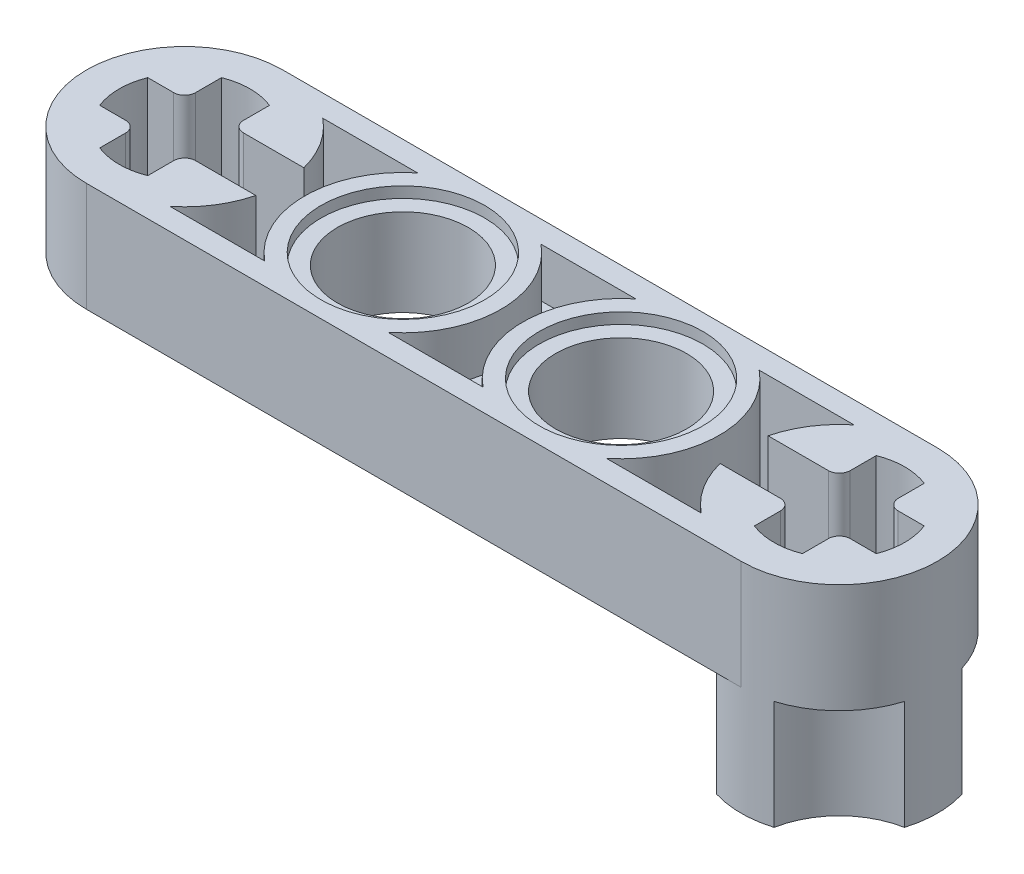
ISO-10303-21;
HEADER;
FILE_DESCRIPTION(('STEP AP214'),'2;1');
FILE_NAME('part.step','',(''),(''),'','','');
FILE_SCHEMA(('AUTOMOTIVE_DESIGN { 1 0 10303 214 1 1 1 1 }'));
ENDSEC;
DATA;
#1=APPLICATION_CONTEXT('core data for automotive mechanical design processes');
#2=APPLICATION_PROTOCOL_DEFINITION('international standard','automotive_design',2000,#1);
#3=PRODUCT_CONTEXT('',#1,'mechanical');
#4=PRODUCT('Part','Part','',(#3));
#5=PRODUCT_RELATED_PRODUCT_CATEGORY('part','',(#4));
#6=PRODUCT_DEFINITION_FORMATION('','',#4);
#7=PRODUCT_DEFINITION_CONTEXT('part definition',#1,'design');
#8=PRODUCT_DEFINITION('design','',#6,#7);
#9=PRODUCT_DEFINITION_SHAPE('','',#8);
#10=(LENGTH_UNIT() NAMED_UNIT(*) SI_UNIT(.MILLI.,.METRE.));
#11=(NAMED_UNIT(*) PLANE_ANGLE_UNIT() SI_UNIT($,.RADIAN.));
#12=(NAMED_UNIT(*) SI_UNIT($,.STERADIAN.) SOLID_ANGLE_UNIT());
#13=UNCERTAINTY_MEASURE_WITH_UNIT(LENGTH_MEASURE(1.E-05),#10,'distance_accuracy_value','');
#14=(GEOMETRIC_REPRESENTATION_CONTEXT(3) GLOBAL_UNCERTAINTY_ASSIGNED_CONTEXT((#13)) GLOBAL_UNIT_ASSIGNED_CONTEXT((#10,
#11,#12)) REPRESENTATION_CONTEXT('',''));
#15=CARTESIAN_POINT('',(0.,0.,0.));
#16=DIRECTION('',(0.,0.,1.));
#17=DIRECTION('',(1.,0.,0.));
#18=AXIS2_PLACEMENT_3D('',#15,#16,#17);
#19=CARTESIAN_POINT('',(-12.,0.,0.));
#20=DIRECTION('',(0.,1.,0.));
#21=DIRECTION('',(0.,0.,1.));
#22=AXIS2_PLACEMENT_3D('',#19,#20,#21);
#23=PLANE('',#22);
#24=CARTESIAN_POINT('',(4.,0.,0.));
#25=DIRECTION('',(0.,-1.,0.));
#26=DIRECTION('',(0.,0.,1.));
#27=AXIS2_PLACEMENT_3D('',#24,#25,#26);
#28=CIRCLE('',#27,3.6);
#29=CARTESIAN_POINT('',(1.73725830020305,0.,2.8));
#30=VERTEX_POINT('',#29);
#31=CARTESIAN_POINT('',(1.73725830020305,0.,-2.8));
#32=VERTEX_POINT('',#31);
#33=EDGE_CURVE('E492',#30,#32,#28,.T.);
#34=ORIENTED_EDGE('',*,*,#33,.T.);
#35=DIRECTION('',(-1.,0.,0.));
#36=VECTOR('',#35,1.);
#37=CARTESIAN_POINT('',(-1.73725830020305,0.,-2.8));
#38=LINE('',#37,#36);
#39=CARTESIAN_POINT('',(-1.73725830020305,0.,-2.8));
#40=VERTEX_POINT('',#39);
#41=EDGE_CURVE('E485',#32,#40,#38,.T.);
#42=ORIENTED_EDGE('',*,*,#41,.T.);
#43=CARTESIAN_POINT('',(-4.,0.,0.));
#44=DIRECTION('',(0.,-1.,0.));
#45=DIRECTION('',(0.,0.,1.));
#46=AXIS2_PLACEMENT_3D('',#43,#44,#45);
#47=CIRCLE('',#46,3.6);
#48=CARTESIAN_POINT('',(-1.73725830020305,0.,2.8));
#49=VERTEX_POINT('',#48);
#50=EDGE_CURVE('E499',#40,#49,#47,.T.);
#51=ORIENTED_EDGE('',*,*,#50,.T.);
#52=DIRECTION('',(1.,0.,0.));
#53=VECTOR('',#52,1.);
#54=CARTESIAN_POINT('',(-1.73725830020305,0.,2.8));
#55=LINE('',#54,#53);
#56=EDGE_CURVE('E495',#49,#30,#55,.T.);
#57=ORIENTED_EDGE('',*,*,#56,.T.);
#58=EDGE_LOOP('',(#34,#42,#51,#57));
#59=FACE_BOUND('',#58,.T.);
#60=CARTESIAN_POINT('',(-12.,0.,0.));
#61=DIRECTION('',(0.,1.,0.));
#62=DIRECTION('',(0.,0.,1.));
#63=AXIS2_PLACEMENT_3D('',#60,#61,#62);
#64=CIRCLE('',#63,2.4);
#65=CARTESIAN_POINT('',(-12.88,0.,2.23284571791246));
#66=VERTEX_POINT('',#65);
#67=CARTESIAN_POINT('',(-11.12,0.,2.23284571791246));
#68=VERTEX_POINT('',#67);
#69=EDGE_CURVE('E683',#66,#68,#64,.T.);
#70=ORIENTED_EDGE('',*,*,#69,.T.);
#71=DIRECTION('',(0.,0.,-1.));
#72=VECTOR('',#71,1.);
#73=CARTESIAN_POINT('',(-11.12,0.,1.28));
#74=LINE('',#73,#72);
#75=CARTESIAN_POINT('',(-11.12,0.,1.28));
#76=VERTEX_POINT('',#75);
#77=EDGE_CURVE('E729',#68,#76,#74,.T.);
#78=ORIENTED_EDGE('',*,*,#77,.T.);
#79=CARTESIAN_POINT('',(-10.72,0.,1.28));
#80=DIRECTION('',(0.,-1.,0.));
#81=DIRECTION('',(0.,0.,1.));
#82=AXIS2_PLACEMENT_3D('',#79,#80,#81);
#83=CIRCLE('',#82,0.4);
#84=CARTESIAN_POINT('',(-10.72,0.,0.88));
#85=VERTEX_POINT('',#84);
#86=EDGE_CURVE('E732',#76,#85,#83,.T.);
#87=ORIENTED_EDGE('',*,*,#86,.T.);
#88=DIRECTION('',(1.,0.,0.));
#89=VECTOR('',#88,1.);
#90=CARTESIAN_POINT('',(-9.76715428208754,0.,0.88));
#91=LINE('',#90,#89);
#92=CARTESIAN_POINT('',(-8.50921212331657,0.,0.88));
#93=VERTEX_POINT('',#92);
#94=EDGE_CURVE('E735',#85,#93,#91,.T.);
#95=ORIENTED_EDGE('',*,*,#94,.T.);
#96=CARTESIAN_POINT('',(-12.,0.,0.));
#97=DIRECTION('',(0.,-1.,0.));
#98=DIRECTION('',(0.,0.,1.));
#99=AXIS2_PLACEMENT_3D('',#96,#97,#98);
#100=CIRCLE('',#99,3.6);
#101=CARTESIAN_POINT('',(-9.73725830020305,0.,2.8));
#102=VERTEX_POINT('',#101);
#103=EDGE_CURVE('E738',#93,#102,#100,.T.);
#104=ORIENTED_EDGE('',*,*,#103,.T.);
#105=DIRECTION('',(1.,0.,0.));
#106=VECTOR('',#105,1.);
#107=CARTESIAN_POINT('',(-9.73725830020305,0.,2.8));
#108=LINE('',#107,#106);
#109=CARTESIAN_POINT('',(-6.26274169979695,0.,2.8));
#110=VERTEX_POINT('',#109);
#111=EDGE_CURVE('E741',#102,#110,#108,.T.);
#112=ORIENTED_EDGE('',*,*,#111,.T.);
#113=CARTESIAN_POINT('',(-4.,0.,0.));
#114=DIRECTION('',(0.,-1.,0.));
#115=DIRECTION('',(0.,0.,1.));
#116=AXIS2_PLACEMENT_3D('',#113,#114,#115);
#117=CIRCLE('',#116,3.6);
#118=CARTESIAN_POINT('',(-6.26274169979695,0.,-2.8));
#119=VERTEX_POINT('',#118);
#120=EDGE_CURVE('E744',#110,#119,#117,.T.);
#121=ORIENTED_EDGE('',*,*,#120,.T.);
#122=DIRECTION('',(-1.,0.,0.));
#123=VECTOR('',#122,1.);
#124=CARTESIAN_POINT('',(-9.73725830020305,0.,-2.8));
#125=LINE('',#124,#123);
#126=CARTESIAN_POINT('',(-9.73725830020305,0.,-2.8));
#127=VERTEX_POINT('',#126);
#128=EDGE_CURVE('E747',#119,#127,#125,.T.);
#129=ORIENTED_EDGE('',*,*,#128,.T.);
#130=CARTESIAN_POINT('',(-12.,0.,0.));
#131=DIRECTION('',(0.,-1.,0.));
#132=DIRECTION('',(0.,0.,1.));
#133=AXIS2_PLACEMENT_3D('',#130,#131,#132);
#134=CIRCLE('',#133,3.6);
#135=CARTESIAN_POINT('',(-8.50921212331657,0.,-0.879999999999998));
#136=VERTEX_POINT('',#135);
#137=EDGE_CURVE('E750',#127,#136,#134,.T.);
#138=ORIENTED_EDGE('',*,*,#137,.T.);
#139=DIRECTION('',(-1.,0.,0.));
#140=VECTOR('',#139,1.);
#141=CARTESIAN_POINT('',(-10.72,0.,-0.879999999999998));
#142=LINE('',#141,#140);
#143=CARTESIAN_POINT('',(-10.72,0.,-0.879999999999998));
#144=VERTEX_POINT('',#143);
#145=EDGE_CURVE('E753',#136,#144,#142,.T.);
#146=ORIENTED_EDGE('',*,*,#145,.T.);
#147=CARTESIAN_POINT('',(-10.72,0.,-1.28));
#148=DIRECTION('',(0.,-1.,0.));
#149=DIRECTION('',(0.,0.,-1.));
#150=AXIS2_PLACEMENT_3D('',#147,#148,#149);
#151=CIRCLE('',#150,0.4);
#152=CARTESIAN_POINT('',(-11.12,0.,-1.28));
#153=VERTEX_POINT('',#152);
#154=EDGE_CURVE('E756',#144,#153,#151,.T.);
#155=ORIENTED_EDGE('',*,*,#154,.T.);
#156=DIRECTION('',(0.,0.,-1.));
#157=VECTOR('',#156,1.);
#158=CARTESIAN_POINT('',(-11.12,0.,-2.23284571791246));
#159=LINE('',#158,#157);
#160=CARTESIAN_POINT('',(-11.12,0.,-2.23284571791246));
#161=VERTEX_POINT('',#160);
#162=EDGE_CURVE('E759',#153,#161,#159,.T.);
#163=ORIENTED_EDGE('',*,*,#162,.T.);
#164=CARTESIAN_POINT('',(-12.,0.,0.));
#165=DIRECTION('',(0.,1.,0.));
#166=DIRECTION('',(0.,0.,1.));
#167=AXIS2_PLACEMENT_3D('',#164,#165,#166);
#168=CIRCLE('',#167,2.4);
#169=CARTESIAN_POINT('',(-12.88,0.,-2.23284571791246));
#170=VERTEX_POINT('',#169);
#171=EDGE_CURVE('E762',#161,#170,#168,.T.);
#172=ORIENTED_EDGE('',*,*,#171,.T.);
#173=DIRECTION('',(0.,0.,1.));
#174=VECTOR('',#173,1.);
#175=CARTESIAN_POINT('',(-12.88,0.,-1.28));
#176=LINE('',#175,#174);
#177=CARTESIAN_POINT('',(-12.88,0.,-1.28));
#178=VERTEX_POINT('',#177);
#179=EDGE_CURVE('E765',#170,#178,#176,.T.);
#180=ORIENTED_EDGE('',*,*,#179,.T.);
#181=CARTESIAN_POINT('',(-13.28,0.,-1.28));
#182=DIRECTION('',(0.,-1.,0.));
#183=DIRECTION('',(0.,0.,1.));
#184=AXIS2_PLACEMENT_3D('',#181,#182,#183);
#185=CIRCLE('',#184,0.4);
#186=CARTESIAN_POINT('',(-13.28,0.,-0.879999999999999));
#187=VERTEX_POINT('',#186);
#188=EDGE_CURVE('E768',#178,#187,#185,.T.);
#189=ORIENTED_EDGE('',*,*,#188,.T.);
#190=DIRECTION('',(-1.,0.,0.));
#191=VECTOR('',#190,1.);
#192=CARTESIAN_POINT('',(-14.2328457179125,0.,-0.88));
#193=LINE('',#192,#191);
#194=CARTESIAN_POINT('',(-14.2328457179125,0.,-0.88));
#195=VERTEX_POINT('',#194);
#196=EDGE_CURVE('E771',#187,#195,#193,.T.);
#197=ORIENTED_EDGE('',*,*,#196,.T.);
#198=CARTESIAN_POINT('',(-12.,0.,0.));
#199=DIRECTION('',(0.,1.,0.));
#200=DIRECTION('',(0.,0.,1.));
#201=AXIS2_PLACEMENT_3D('',#198,#199,#200);
#202=CIRCLE('',#201,2.4);
#203=CARTESIAN_POINT('',(-14.2328457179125,0.,0.879999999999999));
#204=VERTEX_POINT('',#203);
#205=EDGE_CURVE('E774',#195,#204,#202,.T.);
#206=ORIENTED_EDGE('',*,*,#205,.T.);
#207=DIRECTION('',(1.,0.,0.));
#208=VECTOR('',#207,1.);
#209=CARTESIAN_POINT('',(-14.2328457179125,0.,0.88));
#210=LINE('',#209,#208);
#211=CARTESIAN_POINT('',(-13.28,0.,0.88));
#212=VERTEX_POINT('',#211);
#213=EDGE_CURVE('E777',#204,#212,#210,.T.);
#214=ORIENTED_EDGE('',*,*,#213,.T.);
#215=CARTESIAN_POINT('',(-13.28,0.,1.28));
#216=DIRECTION('',(0.,-1.,0.));
#217=DIRECTION('',(0.,0.,1.));
#218=AXIS2_PLACEMENT_3D('',#215,#216,#217);
#219=CIRCLE('',#218,0.4);
#220=CARTESIAN_POINT('',(-12.88,0.,1.28));
#221=VERTEX_POINT('',#220);
#222=EDGE_CURVE('E780',#212,#221,#219,.T.);
#223=ORIENTED_EDGE('',*,*,#222,.T.);
#224=DIRECTION('',(0.,0.,1.));
#225=VECTOR('',#224,1.);
#226=CARTESIAN_POINT('',(-12.88,0.,2.23284571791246));
#227=LINE('',#226,#225);
#228=EDGE_CURVE('E687',#221,#66,#227,.T.);
#229=ORIENTED_EDGE('',*,*,#228,.T.);
#230=EDGE_LOOP('',(#70,#78,#87,#95,#104,#112,#121,#129,#138,#146,#155,#163,#172,#180,#189,#197,
#206,#214,#223,#229));
#231=FACE_BOUND('',#230,.T.);
#232=CARTESIAN_POINT('',(4.,0.,0.));
#233=DIRECTION('',(0.,-1.,0.));
#234=DIRECTION('',(0.,0.,-1.));
#235=AXIS2_PLACEMENT_3D('',#232,#233,#234);
#236=CIRCLE('',#235,3.);
#237=CARTESIAN_POINT('',(4.,0.,-3.));
#238=VERTEX_POINT('',#237);
#239=EDGE_CURVE('E478',#238,#238,#236,.T.);
#240=ORIENTED_EDGE('',*,*,#239,.F.);
#241=EDGE_LOOP('',(#240));
#242=FACE_BOUND('',#241,.T.);
#243=CARTESIAN_POINT('',(-4.,0.,0.));
#244=DIRECTION('',(0.,-1.,0.));
#245=DIRECTION('',(0.,0.,-1.));
#246=AXIS2_PLACEMENT_3D('',#243,#244,#245);
#247=CIRCLE('',#246,3.);
#248=CARTESIAN_POINT('',(-4.,0.,-3.));
#249=VERTEX_POINT('',#248);
#250=EDGE_CURVE('E472',#249,#249,#247,.T.);
#251=ORIENTED_EDGE('',*,*,#250,.F.);
#252=EDGE_LOOP('',(#251));
#253=FACE_BOUND('',#252,.T.);
#254=CARTESIAN_POINT('',(8.,0.,-4.));
#255=DIRECTION('',(0.,1.,0.));
#256=DIRECTION('',(0.,0.,-1.));
#257=AXIS2_PLACEMENT_3D('',#254,#255,#256);
#258=CIRCLE('',#257,3.);
#259=CARTESIAN_POINT('',(8.55719930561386,0.,-1.05219930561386));
#260=VERTEX_POINT('',#259);
#261=CARTESIAN_POINT('',(10.9478006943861,0.,-3.44280069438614));
#262=VERTEX_POINT('',#261);
#263=EDGE_CURVE('E929',#260,#262,#258,.T.);
#264=ORIENTED_EDGE('',*,*,#263,.F.);
#265=CARTESIAN_POINT('',(12.,0.,0.));
#266=DIRECTION('',(0.,-1.,0.));
#267=DIRECTION('',(0.,0.,1.));
#268=AXIS2_PLACEMENT_3D('',#265,#266,#267);
#269=CIRCLE('',#268,3.6);
#270=CARTESIAN_POINT('',(9.73725830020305,0.,-2.8));
#271=VERTEX_POINT('',#270);
#272=EDGE_CURVE('E625',#260,#271,#269,.T.);
#273=ORIENTED_EDGE('',*,*,#272,.T.);
#274=DIRECTION('',(-1.,0.,0.));
#275=VECTOR('',#274,1.);
#276=CARTESIAN_POINT('',(6.26274169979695,0.,-2.8));
#277=LINE('',#276,#275);
#278=CARTESIAN_POINT('',(6.26274169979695,0.,-2.8));
#279=VERTEX_POINT('',#278);
#280=EDGE_CURVE('E627',#271,#279,#277,.T.);
#281=ORIENTED_EDGE('',*,*,#280,.T.);
#282=CARTESIAN_POINT('',(4.,0.,0.));
#283=DIRECTION('',(0.,-1.,0.));
#284=DIRECTION('',(0.,0.,1.));
#285=AXIS2_PLACEMENT_3D('',#282,#283,#284);
#286=CIRCLE('',#285,3.6);
#287=CARTESIAN_POINT('',(6.26274169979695,0.,2.8));
#288=VERTEX_POINT('',#287);
#289=EDGE_CURVE('E630',#279,#288,#286,.T.);
#290=ORIENTED_EDGE('',*,*,#289,.T.);
#291=DIRECTION('',(1.,0.,0.));
#292=VECTOR('',#291,1.);
#293=CARTESIAN_POINT('',(6.26274169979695,0.,2.8));
#294=LINE('',#293,#292);
#295=CARTESIAN_POINT('',(9.73725830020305,0.,2.8));
#296=VERTEX_POINT('',#295);
#297=EDGE_CURVE('E633',#288,#296,#294,.T.);
#298=ORIENTED_EDGE('',*,*,#297,.T.);
#299=CARTESIAN_POINT('',(12.,0.,0.));
#300=DIRECTION('',(0.,-1.,0.));
#301=DIRECTION('',(0.,0.,1.));
#302=AXIS2_PLACEMENT_3D('',#299,#300,#301);
#303=CIRCLE('',#302,3.6);
#304=CARTESIAN_POINT('',(8.55719930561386,0.,1.05219930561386));
#305=VERTEX_POINT('',#304);
#306=EDGE_CURVE('E549',#296,#305,#303,.T.);
#307=ORIENTED_EDGE('',*,*,#306,.T.);
#308=CARTESIAN_POINT('',(8.,0.,4.));
#309=DIRECTION('',(0.,1.,0.));
#310=DIRECTION('',(0.,0.,-1.));
#311=AXIS2_PLACEMENT_3D('',#308,#309,#310);
#312=CIRCLE('',#311,3.);
#313=CARTESIAN_POINT('',(10.9478006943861,0.,3.44280069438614));
#314=VERTEX_POINT('',#313);
#315=EDGE_CURVE('E62',#314,#305,#312,.T.);
#316=ORIENTED_EDGE('',*,*,#315,.F.);
#317=CARTESIAN_POINT('',(12.,0.,0.));
#318=DIRECTION('',(0.,-1.,0.));
#319=DIRECTION('',(0.,0.,-1.));
#320=AXIS2_PLACEMENT_3D('',#317,#318,#319);
#321=CIRCLE('',#320,3.6);
#322=CARTESIAN_POINT('',(12.,0.,3.6));
#323=VERTEX_POINT('',#322);
#324=EDGE_CURVE('E445',#323,#314,#321,.T.);
#325=ORIENTED_EDGE('',*,*,#324,.F.);
#326=DIRECTION('',(1.,0.,0.));
#327=VECTOR('',#326,1.);
#328=CARTESIAN_POINT('',(12.,0.,3.6));
#329=LINE('',#328,#327);
#330=CARTESIAN_POINT('',(-12.,0.,3.6));
#331=VERTEX_POINT('',#330);
#332=EDGE_CURVE('E842',#331,#323,#329,.T.);
#333=ORIENTED_EDGE('',*,*,#332,.F.);
#334=CARTESIAN_POINT('',(-12.,0.,0.));
#335=DIRECTION('',(0.,1.,0.));
#336=DIRECTION('',(0.,0.,1.));
#337=AXIS2_PLACEMENT_3D('',#334,#335,#336);
#338=CIRCLE('',#337,3.6);
#339=CARTESIAN_POINT('',(-12.,0.,-3.6));
#340=VERTEX_POINT('',#339);
#341=EDGE_CURVE('E828',#340,#331,#338,.T.);
#342=ORIENTED_EDGE('',*,*,#341,.F.);
#343=DIRECTION('',(-1.,0.,0.));
#344=VECTOR('',#343,1.);
#345=CARTESIAN_POINT('',(-12.,0.,-3.6));
#346=LINE('',#345,#344);
#347=CARTESIAN_POINT('',(12.,0.,-3.6));
#348=VERTEX_POINT('',#347);
#349=EDGE_CURVE('E833',#348,#340,#346,.T.);
#350=ORIENTED_EDGE('',*,*,#349,.F.);
#351=CARTESIAN_POINT('',(12.,0.,0.));
#352=DIRECTION('',(0.,-1.,0.));
#353=DIRECTION('',(0.,0.,-1.));
#354=AXIS2_PLACEMENT_3D('',#351,#352,#353);
#355=CIRCLE('',#354,3.6);
#356=EDGE_CURVE('E55',#262,#348,#355,.T.);
#357=ORIENTED_EDGE('',*,*,#356,.F.);
#358=EDGE_LOOP('',(#264,#273,#281,#290,#298,#307,#316,#325,#333,#342,#350,#357));
#359=FACE_BOUND('',#358,.T.);
#360=ADVANCED_FACE('F38',(#59,#231,#242,#253,#359),#23,.F.);
#361=CARTESIAN_POINT('',(16.,0.,-4.));
#362=DIRECTION('',(0.,1.,0.));
#363=DIRECTION('',(0.,0.,-1.));
#364=AXIS2_PLACEMENT_3D('',#361,#362,#363);
#365=CIRCLE('',#364,3.);
#366=CARTESIAN_POINT('',(13.0521993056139,0.,-3.44280069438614));
#367=VERTEX_POINT('',#366);
#368=CARTESIAN_POINT('',(15.4428006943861,0.,-1.05219930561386));
#369=VERTEX_POINT('',#368);
#370=EDGE_CURVE('E937',#367,#369,#365,.T.);
#371=ORIENTED_EDGE('',*,*,#370,.F.);
#372=CARTESIAN_POINT('',(12.,0.,0.));
#373=DIRECTION('',(0.,1.,0.));
#374=DIRECTION('',(0.,0.,1.));
#375=AXIS2_PLACEMENT_3D('',#372,#373,#374);
#376=CIRCLE('',#375,3.6);
#377=EDGE_CURVE('E845',#369,#367,#376,.T.);
#378=ORIENTED_EDGE('',*,*,#377,.F.);
#379=EDGE_LOOP('',(#371,#378));
#380=FACE_BOUND('',#379,.T.);
#381=ADVANCED_FACE('F1086',(#380),#23,.F.);
#382=CARTESIAN_POINT('',(16.,0.,4.));
#383=DIRECTION('',(0.,1.,0.));
#384=DIRECTION('',(0.,0.,-1.));
#385=AXIS2_PLACEMENT_3D('',#382,#383,#384);
#386=CIRCLE('',#385,3.);
#387=CARTESIAN_POINT('',(15.4428006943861,0.,1.05219930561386));
#388=VERTEX_POINT('',#387);
#389=CARTESIAN_POINT('',(13.0521993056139,0.,3.44280069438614));
#390=VERTEX_POINT('',#389);
#391=EDGE_CURVE('E940',#388,#390,#386,.T.);
#392=ORIENTED_EDGE('',*,*,#391,.F.);
#393=EDGE_CURVE('E848',#390,#388,#376,.T.);
#394=ORIENTED_EDGE('',*,*,#393,.F.);
#395=EDGE_LOOP('',(#392,#394));
#396=FACE_BOUND('',#395,.T.);
#397=ADVANCED_FACE('F1091',(#396),#23,.F.);
#398=DIRECTION('',(0.,0.,1.));
#399=VECTOR('',#398,1.);
#400=CARTESIAN_POINT('',(11.12,0.,1.28));
#401=LINE('',#400,#399);
#402=CARTESIAN_POINT('',(11.12,0.,1.28));
#403=VERTEX_POINT('',#402);
#404=CARTESIAN_POINT('',(11.12,0.,2.23284571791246));
#405=VERTEX_POINT('',#404);
#406=EDGE_CURVE('E595',#403,#405,#401,.T.);
#407=ORIENTED_EDGE('',*,*,#406,.T.);
#408=CARTESIAN_POINT('',(12.,0.,0.));
#409=DIRECTION('',(0.,-1.,0.));
#410=DIRECTION('',(0.,0.,-1.));
#411=AXIS2_PLACEMENT_3D('',#408,#409,#410);
#412=CIRCLE('',#411,2.4);
#413=CARTESIAN_POINT('',(9.76715428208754,0.,0.880000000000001));
#414=VERTEX_POINT('',#413);
#415=EDGE_CURVE('E916',#405,#414,#412,.T.);
#416=ORIENTED_EDGE('',*,*,#415,.T.);
#417=DIRECTION('',(1.,0.,0.));
#418=VECTOR('',#417,1.);
#419=CARTESIAN_POINT('',(9.76715428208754,0.,0.880000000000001));
#420=LINE('',#419,#418);
#421=CARTESIAN_POINT('',(10.72,0.,0.880000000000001));
#422=VERTEX_POINT('',#421);
#423=EDGE_CURVE('E539',#414,#422,#420,.T.);
#424=ORIENTED_EDGE('',*,*,#423,.T.);
#425=CARTESIAN_POINT('',(10.72,0.,1.28));
#426=DIRECTION('',(0.,-1.,0.));
#427=DIRECTION('',(0.,0.,-1.));
#428=AXIS2_PLACEMENT_3D('',#425,#426,#427);
#429=CIRCLE('',#428,0.4);
#430=EDGE_CURVE('E592',#422,#403,#429,.T.);
#431=ORIENTED_EDGE('',*,*,#430,.T.);
#432=EDGE_LOOP('',(#407,#416,#424,#431));
#433=FACE_BOUND('',#432,.T.);
#434=ADVANCED_FACE('F914',(#433),#23,.F.);
#435=DIRECTION('',(-1.,0.,0.));
#436=VECTOR('',#435,1.);
#437=CARTESIAN_POINT('',(9.76715428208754,0.,-0.879999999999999));
#438=LINE('',#437,#436);
#439=CARTESIAN_POINT('',(10.72,0.,-0.88));
#440=VERTEX_POINT('',#439);
#441=CARTESIAN_POINT('',(9.76715428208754,0.,-0.879999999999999));
#442=VERTEX_POINT('',#441);
#443=EDGE_CURVE('E622',#440,#442,#438,.T.);
#444=ORIENTED_EDGE('',*,*,#443,.T.);
#445=CARTESIAN_POINT('',(11.12,0.,-2.23284571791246));
#446=VERTEX_POINT('',#445);
#447=EDGE_CURVE('E997',#442,#446,#412,.T.);
#448=ORIENTED_EDGE('',*,*,#447,.T.);
#449=DIRECTION('',(0.,0.,1.));
#450=VECTOR('',#449,1.);
#451=CARTESIAN_POINT('',(11.12,0.,-2.23284571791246));
#452=LINE('',#451,#450);
#453=CARTESIAN_POINT('',(11.12,0.,-1.28));
#454=VERTEX_POINT('',#453);
#455=EDGE_CURVE('E616',#446,#454,#452,.T.);
#456=ORIENTED_EDGE('',*,*,#455,.T.);
#457=CARTESIAN_POINT('',(10.72,0.,-1.28));
#458=DIRECTION('',(0.,-1.,0.));
#459=DIRECTION('',(0.,0.,1.));
#460=AXIS2_PLACEMENT_3D('',#457,#458,#459);
#461=CIRCLE('',#460,0.4);
#462=EDGE_CURVE('E619',#454,#440,#461,.T.);
#463=ORIENTED_EDGE('',*,*,#462,.T.);
#464=EDGE_LOOP('',(#444,#448,#456,#463));
#465=FACE_BOUND('',#464,.T.);
#466=ADVANCED_FACE('F994',(#465),#23,.F.);
#467=DIRECTION('',(0.,0.,-1.));
#468=VECTOR('',#467,1.);
#469=CARTESIAN_POINT('',(12.88,0.,-1.28));
#470=LINE('',#469,#468);
#471=CARTESIAN_POINT('',(12.88,0.,-1.28));
#472=VERTEX_POINT('',#471);
#473=CARTESIAN_POINT('',(12.88,0.,-2.23284571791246));
#474=VERTEX_POINT('',#473);
#475=EDGE_CURVE('E613',#472,#474,#470,.T.);
#476=ORIENTED_EDGE('',*,*,#475,.T.);
#477=CARTESIAN_POINT('',(14.2328457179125,0.,-0.88));
#478=VERTEX_POINT('',#477);
#479=EDGE_CURVE('E1009',#474,#478,#412,.T.);
#480=ORIENTED_EDGE('',*,*,#479,.T.);
#481=DIRECTION('',(-1.,0.,0.));
#482=VECTOR('',#481,1.);
#483=CARTESIAN_POINT('',(14.2328457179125,0.,-0.88));
#484=LINE('',#483,#482);
#485=CARTESIAN_POINT('',(13.28,0.,-0.88));
#486=VERTEX_POINT('',#485);
#487=EDGE_CURVE('E607',#478,#486,#484,.T.);
#488=ORIENTED_EDGE('',*,*,#487,.T.);
#489=CARTESIAN_POINT('',(13.28,0.,-1.28));
#490=DIRECTION('',(0.,-1.,0.));
#491=DIRECTION('',(0.,0.,-1.));
#492=AXIS2_PLACEMENT_3D('',#489,#490,#491);
#493=CIRCLE('',#492,0.4);
#494=EDGE_CURVE('E610',#486,#472,#493,.T.);
#495=ORIENTED_EDGE('',*,*,#494,.T.);
#496=EDGE_LOOP('',(#476,#480,#488,#495));
#497=FACE_BOUND('',#496,.T.);
#498=ADVANCED_FACE('F1015',(#497),#23,.F.);
#499=CARTESIAN_POINT('',(-4.,4.,0.));
#500=DIRECTION('',(0.,-1.,0.));
#501=DIRECTION('',(0.,0.,-1.));
#502=AXIS2_PLACEMENT_3D('',#499,#500,#501);
#503=CYLINDRICAL_SURFACE('',#502,2.4);
#504=CARTESIAN_POINT('',(-4.,0.4,0.));
#505=DIRECTION('',(0.,-1.,0.));
#506=DIRECTION('',(0.,0.,-1.));
#507=AXIS2_PLACEMENT_3D('',#504,#505,#506);
#508=CIRCLE('',#507,2.4);
#509=CARTESIAN_POINT('',(-4.,0.4,-2.4));
#510=VERTEX_POINT('',#509);
#511=EDGE_CURVE('E496',#510,#510,#508,.T.);
#512=ORIENTED_EDGE('',*,*,#511,.T.);
#513=EDGE_LOOP('',(#512));
#514=FACE_BOUND('',#513,.T.);
#515=CARTESIAN_POINT('',(-4.,3.6,0.));
#516=DIRECTION('',(0.,1.,0.));
#517=DIRECTION('',(0.,0.,1.));
#518=AXIS2_PLACEMENT_3D('',#515,#516,#517);
#519=CIRCLE('',#518,2.4);
#520=CARTESIAN_POINT('',(-4.,3.6,2.4));
#521=VERTEX_POINT('',#520);
#522=EDGE_CURVE('E42',#521,#521,#519,.T.);
#523=ORIENTED_EDGE('',*,*,#522,.T.);
#524=EDGE_LOOP('',(#523));
#525=FACE_BOUND('',#524,.T.);
#526=ADVANCED_FACE('F865',(#514,#525),#503,.F.);
#527=CARTESIAN_POINT('',(4.,4.,0.));
#528=DIRECTION('',(0.,-1.,0.));
#529=DIRECTION('',(0.,0.,-1.));
#530=AXIS2_PLACEMENT_3D('',#527,#528,#529);
#531=CYLINDRICAL_SURFACE('',#530,2.4);
#532=CARTESIAN_POINT('',(4.,0.4,0.));
#533=DIRECTION('',(0.,-1.,0.));
#534=DIRECTION('',(0.,0.,-1.));
#535=AXIS2_PLACEMENT_3D('',#532,#533,#534);
#536=CIRCLE('',#535,2.4);
#537=CARTESIAN_POINT('',(4.,0.4,-2.4));
#538=VERTEX_POINT('',#537);
#539=EDGE_CURVE('E471',#538,#538,#536,.T.);
#540=ORIENTED_EDGE('',*,*,#539,.T.);
#541=EDGE_LOOP('',(#540));
#542=FACE_BOUND('',#541,.T.);
#543=CARTESIAN_POINT('',(4.,3.6,0.));
#544=DIRECTION('',(0.,1.,0.));
#545=DIRECTION('',(0.,0.,1.));
#546=AXIS2_PLACEMENT_3D('',#543,#544,#545);
#547=CIRCLE('',#546,2.4);
#548=CARTESIAN_POINT('',(4.,3.6,2.4));
#549=VERTEX_POINT('',#548);
#550=EDGE_CURVE('E459',#549,#549,#547,.T.);
#551=ORIENTED_EDGE('',*,*,#550,.T.);
#552=EDGE_LOOP('',(#551));
#553=FACE_BOUND('',#552,.T.);
#554=ADVANCED_FACE('F1095',(#542,#553),#531,.F.);
#555=DIRECTION('',(1.,0.,0.));
#556=VECTOR('',#555,1.);
#557=CARTESIAN_POINT('',(13.28,0.,0.88));
#558=LINE('',#557,#556);
#559=CARTESIAN_POINT('',(13.28,0.,0.880000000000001));
#560=VERTEX_POINT('',#559);
#561=CARTESIAN_POINT('',(14.2328457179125,0.,0.88));
#562=VERTEX_POINT('',#561);
#563=EDGE_CURVE('E604',#560,#562,#558,.T.);
#564=ORIENTED_EDGE('',*,*,#563,.T.);
#565=CARTESIAN_POINT('',(12.88,0.,2.23284571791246));
#566=VERTEX_POINT('',#565);
#567=EDGE_CURVE('E1029',#562,#566,#412,.T.);
#568=ORIENTED_EDGE('',*,*,#567,.T.);
#569=DIRECTION('',(0.,0.,-1.));
#570=VECTOR('',#569,1.);
#571=CARTESIAN_POINT('',(12.88,0.,2.23284571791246));
#572=LINE('',#571,#570);
#573=CARTESIAN_POINT('',(12.88,0.,1.28));
#574=VERTEX_POINT('',#573);
#575=EDGE_CURVE('E598',#566,#574,#572,.T.);
#576=ORIENTED_EDGE('',*,*,#575,.T.);
#577=CARTESIAN_POINT('',(13.28,0.,1.28));
#578=DIRECTION('',(0.,-1.,0.));
#579=DIRECTION('',(0.,0.,1.));
#580=AXIS2_PLACEMENT_3D('',#577,#578,#579);
#581=CIRCLE('',#580,0.4);
#582=EDGE_CURVE('E601',#574,#560,#581,.T.);
#583=ORIENTED_EDGE('',*,*,#582,.T.);
#584=EDGE_LOOP('',(#564,#568,#576,#583));
#585=FACE_BOUND('',#584,.T.);
#586=ADVANCED_FACE('F883',(#585),#23,.F.);
#587=CARTESIAN_POINT('',(-12.,4.,0.));
#588=DIRECTION('',(0.,1.,0.));
#589=DIRECTION('',(0.,0.,1.));
#590=AXIS2_PLACEMENT_3D('',#587,#588,#589);
#591=PLANE('',#590);
#592=CARTESIAN_POINT('',(-4.,4.,0.));
#593=DIRECTION('',(0.,-1.,0.));
#594=DIRECTION('',(0.,0.,-1.));
#595=AXIS2_PLACEMENT_3D('',#592,#593,#594);
#596=CIRCLE('',#595,3.);
#597=CARTESIAN_POINT('',(-4.,4.,-3.));
#598=VERTEX_POINT('',#597);
#599=EDGE_CURVE('E460',#598,#598,#596,.T.);
#600=ORIENTED_EDGE('',*,*,#599,.T.);
#601=EDGE_LOOP('',(#600));
#602=FACE_BOUND('',#601,.T.);
#603=CARTESIAN_POINT('',(4.,4.,0.));
#604=DIRECTION('',(0.,-1.,0.));
#605=DIRECTION('',(0.,0.,-1.));
#606=AXIS2_PLACEMENT_3D('',#603,#604,#605);
#607=CIRCLE('',#606,3.);
#608=CARTESIAN_POINT('',(4.,4.,-3.));
#609=VERTEX_POINT('',#608);
#610=EDGE_CURVE('E450',#609,#609,#607,.T.);
#611=ORIENTED_EDGE('',*,*,#610,.T.);
#612=EDGE_LOOP('',(#611));
#613=FACE_BOUND('',#612,.T.);
#614=CARTESIAN_POINT('',(4.,4.,0.));
#615=DIRECTION('',(0.,-1.,0.));
#616=DIRECTION('',(0.,0.,1.));
#617=AXIS2_PLACEMENT_3D('',#614,#615,#616);
#618=CIRCLE('',#617,3.6);
#619=CARTESIAN_POINT('',(1.73725830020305,4.,2.8));
#620=VERTEX_POINT('',#619);
#621=CARTESIAN_POINT('',(1.73725830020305,4.,-2.8));
#622=VERTEX_POINT('',#621);
#623=EDGE_CURVE('E507',#620,#622,#618,.T.);
#624=ORIENTED_EDGE('',*,*,#623,.F.);
#625=DIRECTION('',(1.,0.,0.));
#626=VECTOR('',#625,1.);
#627=CARTESIAN_POINT('',(-1.73725830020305,4.,2.8));
#628=LINE('',#627,#626);
#629=CARTESIAN_POINT('',(-1.73725830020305,4.,2.8));
#630=VERTEX_POINT('',#629);
#631=EDGE_CURVE('E518',#630,#620,#628,.T.);
#632=ORIENTED_EDGE('',*,*,#631,.F.);
#633=CARTESIAN_POINT('',(-4.,4.,0.));
#634=DIRECTION('',(0.,-1.,0.));
#635=DIRECTION('',(0.,0.,1.));
#636=AXIS2_PLACEMENT_3D('',#633,#634,#635);
#637=CIRCLE('',#636,3.6);
#638=CARTESIAN_POINT('',(-1.73725830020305,4.,-2.8));
#639=VERTEX_POINT('',#638);
#640=EDGE_CURVE('E532',#639,#630,#637,.T.);
#641=ORIENTED_EDGE('',*,*,#640,.F.);
#642=DIRECTION('',(-1.,0.,0.));
#643=VECTOR('',#642,1.);
#644=CARTESIAN_POINT('',(-1.73725830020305,4.,-2.8));
#645=LINE('',#644,#643);
#646=EDGE_CURVE('E529',#622,#639,#645,.T.);
#647=ORIENTED_EDGE('',*,*,#646,.F.);
#648=EDGE_LOOP('',(#624,#632,#641,#647));
#649=FACE_BOUND('',#648,.T.);
#650=DIRECTION('',(0.,0.,-1.));
#651=VECTOR('',#650,1.);
#652=CARTESIAN_POINT('',(-11.12,4.,1.28));
#653=LINE('',#652,#651);
#654=CARTESIAN_POINT('',(-11.12,4.,2.23284571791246));
#655=VERTEX_POINT('',#654);
#656=CARTESIAN_POINT('',(-11.12,4.,1.28));
#657=VERTEX_POINT('',#656);
#658=EDGE_CURVE('E686',#655,#657,#653,.T.);
#659=ORIENTED_EDGE('',*,*,#658,.F.);
#660=CARTESIAN_POINT('',(-12.,4.,0.));
#661=DIRECTION('',(0.,1.,0.));
#662=DIRECTION('',(0.,0.,1.));
#663=AXIS2_PLACEMENT_3D('',#660,#661,#662);
#664=CIRCLE('',#663,2.4);
#665=CARTESIAN_POINT('',(-12.88,4.,2.23284571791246));
#666=VERTEX_POINT('',#665);
#667=EDGE_CURVE('E684',#666,#655,#664,.T.);
#668=ORIENTED_EDGE('',*,*,#667,.F.);
#669=DIRECTION('',(0.,0.,1.));
#670=VECTOR('',#669,1.);
#671=CARTESIAN_POINT('',(-12.88,4.,2.23284571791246));
#672=LINE('',#671,#670);
#673=CARTESIAN_POINT('',(-12.88,4.,1.28));
#674=VERTEX_POINT('',#673);
#675=EDGE_CURVE('E724',#674,#666,#672,.T.);
#676=ORIENTED_EDGE('',*,*,#675,.F.);
#677=CARTESIAN_POINT('',(-13.28,4.,1.28));
#678=DIRECTION('',(0.,-1.,0.));
#679=DIRECTION('',(0.,0.,1.));
#680=AXIS2_PLACEMENT_3D('',#677,#678,#679);
#681=CIRCLE('',#680,0.4);
#682=CARTESIAN_POINT('',(-13.28,4.,0.88));
#683=VERTEX_POINT('',#682);
#684=EDGE_CURVE('E721',#683,#674,#681,.T.);
#685=ORIENTED_EDGE('',*,*,#684,.F.);
#686=DIRECTION('',(1.,0.,0.));
#687=VECTOR('',#686,1.);
#688=CARTESIAN_POINT('',(-14.2328457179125,4.,0.88));
#689=LINE('',#688,#687);
#690=CARTESIAN_POINT('',(-14.2328457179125,4.,0.879999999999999));
#691=VERTEX_POINT('',#690);
#692=EDGE_CURVE('E719',#691,#683,#689,.T.);
#693=ORIENTED_EDGE('',*,*,#692,.F.);
#694=CARTESIAN_POINT('',(-12.,4.,0.));
#695=DIRECTION('',(0.,1.,0.));
#696=DIRECTION('',(0.,0.,1.));
#697=AXIS2_PLACEMENT_3D('',#694,#695,#696);
#698=CIRCLE('',#697,2.4);
#699=CARTESIAN_POINT('',(-14.2328457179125,4.,-0.88));
#700=VERTEX_POINT('',#699);
#701=EDGE_CURVE('E717',#700,#691,#698,.T.);
#702=ORIENTED_EDGE('',*,*,#701,.F.);
#703=DIRECTION('',(-1.,0.,0.));
#704=VECTOR('',#703,1.);
#705=CARTESIAN_POINT('',(-14.2328457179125,4.,-0.88));
#706=LINE('',#705,#704);
#707=CARTESIAN_POINT('',(-13.28,4.,-0.879999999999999));
#708=VERTEX_POINT('',#707);
#709=EDGE_CURVE('E715',#708,#700,#706,.T.);
#710=ORIENTED_EDGE('',*,*,#709,.F.);
#711=CARTESIAN_POINT('',(-13.28,4.,-1.28));
#712=DIRECTION('',(0.,-1.,0.));
#713=DIRECTION('',(0.,0.,1.));
#714=AXIS2_PLACEMENT_3D('',#711,#712,#713);
#715=CIRCLE('',#714,0.4);
#716=CARTESIAN_POINT('',(-12.88,4.,-1.28));
#717=VERTEX_POINT('',#716);
#718=EDGE_CURVE('E713',#717,#708,#715,.T.);
#719=ORIENTED_EDGE('',*,*,#718,.F.);
#720=DIRECTION('',(0.,0.,1.));
#721=VECTOR('',#720,1.);
#722=CARTESIAN_POINT('',(-12.88,4.,-1.28));
#723=LINE('',#722,#721);
#724=CARTESIAN_POINT('',(-12.88,4.,-2.23284571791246));
#725=VERTEX_POINT('',#724);
#726=EDGE_CURVE('E711',#725,#717,#723,.T.);
#727=ORIENTED_EDGE('',*,*,#726,.F.);
#728=CARTESIAN_POINT('',(-12.,4.,0.));
#729=DIRECTION('',(0.,1.,0.));
#730=DIRECTION('',(0.,0.,1.));
#731=AXIS2_PLACEMENT_3D('',#728,#729,#730);
#732=CIRCLE('',#731,2.4);
#733=CARTESIAN_POINT('',(-11.12,4.,-2.23284571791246));
#734=VERTEX_POINT('',#733);
#735=EDGE_CURVE('E709',#734,#725,#732,.T.);
#736=ORIENTED_EDGE('',*,*,#735,.F.);
#737=DIRECTION('',(0.,0.,-1.));
#738=VECTOR('',#737,1.);
#739=CARTESIAN_POINT('',(-11.12,4.,-2.23284571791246));
#740=LINE('',#739,#738);
#741=CARTESIAN_POINT('',(-11.12,4.,-1.28));
#742=VERTEX_POINT('',#741);
#743=EDGE_CURVE('E707',#742,#734,#740,.T.);
#744=ORIENTED_EDGE('',*,*,#743,.F.);
#745=CARTESIAN_POINT('',(-10.72,4.,-1.28));
#746=DIRECTION('',(0.,-1.,0.));
#747=DIRECTION('',(0.,0.,-1.));
#748=AXIS2_PLACEMENT_3D('',#745,#746,#747);
#749=CIRCLE('',#748,0.4);
#750=CARTESIAN_POINT('',(-10.72,4.,-0.879999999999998));
#751=VERTEX_POINT('',#750);
#752=EDGE_CURVE('E705',#751,#742,#749,.T.);
#753=ORIENTED_EDGE('',*,*,#752,.F.);
#754=DIRECTION('',(-1.,0.,0.));
#755=VECTOR('',#754,1.);
#756=CARTESIAN_POINT('',(-9.76715428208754,4.,-0.879999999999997));
#757=LINE('',#756,#755);
#758=CARTESIAN_POINT('',(-8.50921212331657,4.,-0.879999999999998));
#759=VERTEX_POINT('',#758);
#760=EDGE_CURVE('E703',#759,#751,#757,.T.);
#761=ORIENTED_EDGE('',*,*,#760,.F.);
#762=CARTESIAN_POINT('',(-12.,4.,0.));
#763=DIRECTION('',(0.,-1.,0.));
#764=DIRECTION('',(0.,0.,1.));
#765=AXIS2_PLACEMENT_3D('',#762,#763,#764);
#766=CIRCLE('',#765,3.6);
#767=CARTESIAN_POINT('',(-9.73725830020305,4.,-2.8));
#768=VERTEX_POINT('',#767);
#769=EDGE_CURVE('E701',#768,#759,#766,.T.);
#770=ORIENTED_EDGE('',*,*,#769,.F.);
#771=DIRECTION('',(-1.,0.,0.));
#772=VECTOR('',#771,1.);
#773=CARTESIAN_POINT('',(-9.73725830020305,4.,-2.8));
#774=LINE('',#773,#772);
#775=CARTESIAN_POINT('',(-6.26274169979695,4.,-2.8));
#776=VERTEX_POINT('',#775);
#777=EDGE_CURVE('E699',#776,#768,#774,.T.);
#778=ORIENTED_EDGE('',*,*,#777,.F.);
#779=CARTESIAN_POINT('',(-4.,4.,0.));
#780=DIRECTION('',(0.,-1.,0.));
#781=DIRECTION('',(0.,0.,1.));
#782=AXIS2_PLACEMENT_3D('',#779,#780,#781);
#783=CIRCLE('',#782,3.6);
#784=CARTESIAN_POINT('',(-6.26274169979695,4.,2.8));
#785=VERTEX_POINT('',#784);
#786=EDGE_CURVE('E697',#785,#776,#783,.T.);
#787=ORIENTED_EDGE('',*,*,#786,.F.);
#788=DIRECTION('',(1.,0.,0.));
#789=VECTOR('',#788,1.);
#790=CARTESIAN_POINT('',(-9.73725830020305,4.,2.8));
#791=LINE('',#790,#789);
#792=CARTESIAN_POINT('',(-9.73725830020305,4.,2.8));
#793=VERTEX_POINT('',#792);
#794=EDGE_CURVE('E695',#793,#785,#791,.T.);
#795=ORIENTED_EDGE('',*,*,#794,.F.);
#796=CARTESIAN_POINT('',(-12.,4.,0.));
#797=DIRECTION('',(0.,-1.,0.));
#798=DIRECTION('',(0.,0.,1.));
#799=AXIS2_PLACEMENT_3D('',#796,#797,#798);
#800=CIRCLE('',#799,3.6);
#801=CARTESIAN_POINT('',(-8.50921212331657,4.,0.88));
#802=VERTEX_POINT('',#801);
#803=EDGE_CURVE('E693',#802,#793,#800,.T.);
#804=ORIENTED_EDGE('',*,*,#803,.F.);
#805=DIRECTION('',(1.,0.,0.));
#806=VECTOR('',#805,1.);
#807=CARTESIAN_POINT('',(-10.72,4.,0.88));
#808=LINE('',#807,#806);
#809=CARTESIAN_POINT('',(-10.72,4.,0.88));
#810=VERTEX_POINT('',#809);
#811=EDGE_CURVE('E691',#810,#802,#808,.T.);
#812=ORIENTED_EDGE('',*,*,#811,.F.);
#813=CARTESIAN_POINT('',(-10.72,4.,1.28));
#814=DIRECTION('',(0.,-1.,0.));
#815=DIRECTION('',(0.,0.,1.));
#816=AXIS2_PLACEMENT_3D('',#813,#814,#815);
#817=CIRCLE('',#816,0.4);
#818=EDGE_CURVE('E689',#657,#810,#817,.T.);
#819=ORIENTED_EDGE('',*,*,#818,.F.);
#820=EDGE_LOOP('',(#659,#668,#676,#685,#693,#702,#710,#719,#727,#736,#744,#753,#761,#770,#778,
#787,#795,#804,#812,#819));
#821=FACE_BOUND('',#820,.T.);
#822=CARTESIAN_POINT('',(-12.,4.,0.));
#823=DIRECTION('',(0.,1.,0.));
#824=DIRECTION('',(0.,0.,1.));
#825=AXIS2_PLACEMENT_3D('',#822,#823,#824);
#826=CIRCLE('',#825,3.6);
#827=CARTESIAN_POINT('',(-12.,4.,-3.6));
#828=VERTEX_POINT('',#827);
#829=CARTESIAN_POINT('',(-12.,4.,3.6));
#830=VERTEX_POINT('',#829);
#831=EDGE_CURVE('E829',#828,#830,#826,.T.);
#832=ORIENTED_EDGE('',*,*,#831,.T.);
#833=DIRECTION('',(1.,0.,0.));
#834=VECTOR('',#833,1.);
#835=CARTESIAN_POINT('',(12.,4.,3.6));
#836=LINE('',#835,#834);
#837=CARTESIAN_POINT('',(12.,4.,3.6));
#838=VERTEX_POINT('',#837);
#839=EDGE_CURVE('E832',#830,#838,#836,.T.);
#840=ORIENTED_EDGE('',*,*,#839,.T.);
#841=CARTESIAN_POINT('',(12.,4.,0.));
#842=DIRECTION('',(0.,1.,0.));
#843=DIRECTION('',(0.,0.,1.));
#844=AXIS2_PLACEMENT_3D('',#841,#842,#843);
#845=CIRCLE('',#844,3.6);
#846=CARTESIAN_POINT('',(12.,4.,-3.6));
#847=VERTEX_POINT('',#846);
#848=EDGE_CURVE('E835',#838,#847,#845,.T.);
#849=ORIENTED_EDGE('',*,*,#848,.T.);
#850=DIRECTION('',(-1.,0.,0.));
#851=VECTOR('',#850,1.);
#852=CARTESIAN_POINT('',(-12.,4.,-3.6));
#853=LINE('',#852,#851);
#854=EDGE_CURVE('E837',#847,#828,#853,.T.);
#855=ORIENTED_EDGE('',*,*,#854,.T.);
#856=EDGE_LOOP('',(#832,#840,#849,#855));
#857=FACE_BOUND('',#856,.T.);
#858=CARTESIAN_POINT('',(10.72,4.,1.28));
#859=DIRECTION('',(0.,-1.,0.));
#860=DIRECTION('',(0.,0.,-1.));
#861=AXIS2_PLACEMENT_3D('',#858,#859,#860);
#862=CIRCLE('',#861,0.4);
#863=CARTESIAN_POINT('',(10.72,4.,0.880000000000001));
#864=VERTEX_POINT('',#863);
#865=CARTESIAN_POINT('',(11.12,4.,1.28));
#866=VERTEX_POINT('',#865);
#867=EDGE_CURVE('E548',#864,#866,#862,.T.);
#868=ORIENTED_EDGE('',*,*,#867,.F.);
#869=DIRECTION('',(1.,0.,0.));
#870=VECTOR('',#869,1.);
#871=CARTESIAN_POINT('',(9.76715428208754,4.,0.880000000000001));
#872=LINE('',#871,#870);
#873=CARTESIAN_POINT('',(8.50921212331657,4.,0.880000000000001));
#874=VERTEX_POINT('',#873);
#875=EDGE_CURVE('E546',#874,#864,#872,.T.);
#876=ORIENTED_EDGE('',*,*,#875,.F.);
#877=CARTESIAN_POINT('',(12.,4.,0.));
#878=DIRECTION('',(0.,-1.,0.));
#879=DIRECTION('',(0.,0.,1.));
#880=AXIS2_PLACEMENT_3D('',#877,#878,#879);
#881=CIRCLE('',#880,3.6);
#882=CARTESIAN_POINT('',(9.73725830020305,4.,2.8));
#883=VERTEX_POINT('',#882);
#884=EDGE_CURVE('E586',#883,#874,#881,.T.);
#885=ORIENTED_EDGE('',*,*,#884,.F.);
#886=DIRECTION('',(1.,0.,0.));
#887=VECTOR('',#886,1.);
#888=CARTESIAN_POINT('',(6.26274169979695,4.,2.8));
#889=LINE('',#888,#887);
#890=CARTESIAN_POINT('',(6.26274169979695,4.,2.8));
#891=VERTEX_POINT('',#890);
#892=EDGE_CURVE('E583',#891,#883,#889,.T.);
#893=ORIENTED_EDGE('',*,*,#892,.F.);
#894=CARTESIAN_POINT('',(4.,4.,0.));
#895=DIRECTION('',(0.,-1.,0.));
#896=DIRECTION('',(0.,0.,1.));
#897=AXIS2_PLACEMENT_3D('',#894,#895,#896);
#898=CIRCLE('',#897,3.6);
#899=CARTESIAN_POINT('',(6.26274169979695,4.,-2.8));
#900=VERTEX_POINT('',#899);
#901=EDGE_CURVE('E581',#900,#891,#898,.T.);
#902=ORIENTED_EDGE('',*,*,#901,.F.);
#903=DIRECTION('',(-1.,0.,0.));
#904=VECTOR('',#903,1.);
#905=CARTESIAN_POINT('',(6.26274169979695,4.,-2.8));
#906=LINE('',#905,#904);
#907=CARTESIAN_POINT('',(9.73725830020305,4.,-2.8));
#908=VERTEX_POINT('',#907);
#909=EDGE_CURVE('E579',#908,#900,#906,.T.);
#910=ORIENTED_EDGE('',*,*,#909,.F.);
#911=CARTESIAN_POINT('',(12.,4.,0.));
#912=DIRECTION('',(0.,-1.,0.));
#913=DIRECTION('',(0.,0.,1.));
#914=AXIS2_PLACEMENT_3D('',#911,#912,#913);
#915=CIRCLE('',#914,3.6);
#916=CARTESIAN_POINT('',(8.50921212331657,4.,-0.879999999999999));
#917=VERTEX_POINT('',#916);
#918=EDGE_CURVE('E577',#917,#908,#915,.T.);
#919=ORIENTED_EDGE('',*,*,#918,.F.);
#920=DIRECTION('',(-1.,0.,0.));
#921=VECTOR('',#920,1.);
#922=CARTESIAN_POINT('',(10.72,4.,-0.88));
#923=LINE('',#922,#921);
#924=CARTESIAN_POINT('',(10.72,4.,-0.88));
#925=VERTEX_POINT('',#924);
#926=EDGE_CURVE('E575',#925,#917,#923,.T.);
#927=ORIENTED_EDGE('',*,*,#926,.F.);
#928=CARTESIAN_POINT('',(10.72,4.,-1.28));
#929=DIRECTION('',(0.,-1.,0.));
#930=DIRECTION('',(0.,0.,1.));
#931=AXIS2_PLACEMENT_3D('',#928,#929,#930);
#932=CIRCLE('',#931,0.4);
#933=CARTESIAN_POINT('',(11.12,4.,-1.28));
#934=VERTEX_POINT('',#933);
#935=EDGE_CURVE('E573',#934,#925,#932,.T.);
#936=ORIENTED_EDGE('',*,*,#935,.F.);
#937=DIRECTION('',(0.,0.,1.));
#938=VECTOR('',#937,1.);
#939=CARTESIAN_POINT('',(11.12,4.,-2.23284571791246));
#940=LINE('',#939,#938);
#941=CARTESIAN_POINT('',(11.12,4.,-2.23284571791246));
#942=VERTEX_POINT('',#941);
#943=EDGE_CURVE('E571',#942,#934,#940,.T.);
#944=ORIENTED_EDGE('',*,*,#943,.F.);
#945=CARTESIAN_POINT('',(12.,4.,0.));
#946=DIRECTION('',(0.,1.,0.));
#947=DIRECTION('',(0.,0.,1.));
#948=AXIS2_PLACEMENT_3D('',#945,#946,#947);
#949=CIRCLE('',#948,2.4);
#950=CARTESIAN_POINT('',(12.88,4.,-2.23284571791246));
#951=VERTEX_POINT('',#950);
#952=EDGE_CURVE('E569',#951,#942,#949,.T.);
#953=ORIENTED_EDGE('',*,*,#952,.F.);
#954=DIRECTION('',(0.,0.,-1.));
#955=VECTOR('',#954,1.);
#956=CARTESIAN_POINT('',(12.88,4.,-1.28));
#957=LINE('',#956,#955);
#958=CARTESIAN_POINT('',(12.88,4.,-1.28));
#959=VERTEX_POINT('',#958);
#960=EDGE_CURVE('E567',#959,#951,#957,.T.);
#961=ORIENTED_EDGE('',*,*,#960,.F.);
#962=CARTESIAN_POINT('',(13.28,4.,-1.28));
#963=DIRECTION('',(0.,-1.,0.));
#964=DIRECTION('',(0.,0.,-1.));
#965=AXIS2_PLACEMENT_3D('',#962,#963,#964);
#966=CIRCLE('',#965,0.4);
#967=CARTESIAN_POINT('',(13.28,4.,-0.88));
#968=VERTEX_POINT('',#967);
#969=EDGE_CURVE('E565',#968,#959,#966,.T.);
#970=ORIENTED_EDGE('',*,*,#969,.F.);
#971=DIRECTION('',(-1.,0.,0.));
#972=VECTOR('',#971,1.);
#973=CARTESIAN_POINT('',(14.2328457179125,4.,-0.88));
#974=LINE('',#973,#972);
#975=CARTESIAN_POINT('',(14.2328457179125,4.,-0.88));
#976=VERTEX_POINT('',#975);
#977=EDGE_CURVE('E563',#976,#968,#974,.T.);
#978=ORIENTED_EDGE('',*,*,#977,.F.);
#979=CARTESIAN_POINT('',(12.,4.,0.));
#980=DIRECTION('',(0.,1.,0.));
#981=DIRECTION('',(0.,0.,1.));
#982=AXIS2_PLACEMENT_3D('',#979,#980,#981);
#983=CIRCLE('',#982,2.4);
#984=CARTESIAN_POINT('',(14.2328457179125,4.,0.88));
#985=VERTEX_POINT('',#984);
#986=EDGE_CURVE('E561',#985,#976,#983,.T.);
#987=ORIENTED_EDGE('',*,*,#986,.F.);
#988=DIRECTION('',(1.,0.,0.));
#989=VECTOR('',#988,1.);
#990=CARTESIAN_POINT('',(13.28,4.,0.88));
#991=LINE('',#990,#989);
#992=CARTESIAN_POINT('',(13.28,4.,0.880000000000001));
#993=VERTEX_POINT('',#992);
#994=EDGE_CURVE('E559',#993,#985,#991,.T.);
#995=ORIENTED_EDGE('',*,*,#994,.F.);
#996=CARTESIAN_POINT('',(13.28,4.,1.28));
#997=DIRECTION('',(0.,-1.,0.));
#998=DIRECTION('',(0.,0.,1.));
#999=AXIS2_PLACEMENT_3D('',#996,#997,#998);
#1000=CIRCLE('',#999,0.4);
#1001=CARTESIAN_POINT('',(12.88,4.,1.28));
#1002=VERTEX_POINT('',#1001);
#1003=EDGE_CURVE('E557',#1002,#993,#1000,.T.);
#1004=ORIENTED_EDGE('',*,*,#1003,.F.);
#1005=DIRECTION('',(0.,0.,-1.));
#1006=VECTOR('',#1005,1.);
#1007=CARTESIAN_POINT('',(12.88,4.,2.23284571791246));
#1008=LINE('',#1007,#1006);
#1009=CARTESIAN_POINT('',(12.88,4.,2.23284571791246));
#1010=VERTEX_POINT('',#1009);
#1011=EDGE_CURVE('E555',#1010,#1002,#1008,.T.);
#1012=ORIENTED_EDGE('',*,*,#1011,.F.);
#1013=CARTESIAN_POINT('',(12.,4.,0.));
#1014=DIRECTION('',(0.,1.,0.));
#1015=DIRECTION('',(0.,0.,1.));
#1016=AXIS2_PLACEMENT_3D('',#1013,#1014,#1015);
#1017=CIRCLE('',#1016,2.4);
#1018=CARTESIAN_POINT('',(11.12,4.,2.23284571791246));
#1019=VERTEX_POINT('',#1018);
#1020=EDGE_CURVE('E553',#1019,#1010,#1017,.T.);
#1021=ORIENTED_EDGE('',*,*,#1020,.F.);
#1022=DIRECTION('',(0.,0.,1.));
#1023=VECTOR('',#1022,1.);
#1024=CARTESIAN_POINT('',(11.12,4.,1.28));
#1025=LINE('',#1024,#1023);
#1026=EDGE_CURVE('E551',#866,#1019,#1025,.T.);
#1027=ORIENTED_EDGE('',*,*,#1026,.F.);
#1028=EDGE_LOOP('',(#868,#876,#885,#893,#902,#910,#919,#927,#936,#944,#953,#961,#970,#978,#987,
#995,#1004,#1012,#1021,#1027));
#1029=FACE_BOUND('',#1028,.T.);
#1030=ADVANCED_FACE('F880',(#602,#613,#649,#821,#857,#1029),#591,.T.);
#1031=CARTESIAN_POINT('',(-12.,4.,0.));
#1032=DIRECTION('',(0.,-1.,0.));
#1033=DIRECTION('',(0.,0.,-1.));
#1034=AXIS2_PLACEMENT_3D('',#1031,#1032,#1033);
#1035=CYLINDRICAL_SURFACE('',#1034,3.6);
#1036=ORIENTED_EDGE('',*,*,#341,.T.);
#1037=DIRECTION('',(0.,-1.,0.));
#1038=VECTOR('',#1037,1.);
#1039=CARTESIAN_POINT('',(-12.,4.,3.6));
#1040=LINE('',#1039,#1038);
#1041=EDGE_CURVE('E11',#830,#331,#1040,.T.);
#1042=ORIENTED_EDGE('',*,*,#1041,.F.);
#1043=ORIENTED_EDGE('',*,*,#831,.F.);
#1044=DIRECTION('',(0.,-1.,0.));
#1045=VECTOR('',#1044,1.);
#1046=CARTESIAN_POINT('',(-12.,4.,-3.6));
#1047=LINE('',#1046,#1045);
#1048=EDGE_CURVE('E839',#828,#340,#1047,.T.);
#1049=ORIENTED_EDGE('',*,*,#1048,.T.);
#1050=EDGE_LOOP('',(#1036,#1042,#1043,#1049));
#1051=FACE_BOUND('',#1050,.T.);
#1052=ADVANCED_FACE('F40',(#1051),#1035,.T.);
#1053=CARTESIAN_POINT('',(12.,4.,3.6));
#1054=DIRECTION('',(0.,0.,-1.));
#1055=DIRECTION('',(-1.,0.,0.));
#1056=AXIS2_PLACEMENT_3D('',#1053,#1054,#1055);
#1057=PLANE('',#1056);
#1058=ORIENTED_EDGE('',*,*,#332,.T.);
#1059=DIRECTION('',(0.,-1.,0.));
#1060=VECTOR('',#1059,1.);
#1061=CARTESIAN_POINT('',(12.,4.,3.6));
#1062=LINE('',#1061,#1060);
#1063=EDGE_CURVE('E47',#838,#323,#1062,.T.);
#1064=ORIENTED_EDGE('',*,*,#1063,.F.);
#1065=ORIENTED_EDGE('',*,*,#839,.F.);
#1066=ORIENTED_EDGE('',*,*,#1041,.T.);
#1067=EDGE_LOOP('',(#1058,#1064,#1065,#1066));
#1068=FACE_BOUND('',#1067,.T.);
#1069=ADVANCED_FACE('F1067',(#1068),#1057,.F.);
#1070=CARTESIAN_POINT('',(12.,4.,0.));
#1071=DIRECTION('',(0.,-1.,0.));
#1072=DIRECTION('',(0.,0.,-1.));
#1073=AXIS2_PLACEMENT_3D('',#1070,#1071,#1072);
#1074=CYLINDRICAL_SURFACE('',#1073,3.6);
#1075=ORIENTED_EDGE('',*,*,#1063,.T.);
#1076=ORIENTED_EDGE('',*,*,#324,.T.);
#1077=DIRECTION('',(0.,1.,0.));
#1078=VECTOR('',#1077,1.);
#1079=CARTESIAN_POINT('',(10.9478006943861,-4.,3.44280069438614));
#1080=LINE('',#1079,#1078);
#1081=CARTESIAN_POINT('',(10.9478006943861,-4.,3.44280069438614));
#1082=VERTEX_POINT('',#1081);
#1083=EDGE_CURVE('E944',#1082,#314,#1080,.T.);
#1084=ORIENTED_EDGE('',*,*,#1083,.F.);
#1085=CARTESIAN_POINT('',(12.,-4.,0.));
#1086=DIRECTION('',(0.,-1.,0.));
#1087=DIRECTION('',(0.,0.,-1.));
#1088=AXIS2_PLACEMENT_3D('',#1085,#1086,#1087);
#1089=CIRCLE('',#1088,3.6);
#1090=CARTESIAN_POINT('',(13.0521993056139,-4.,3.44280069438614));
#1091=VERTEX_POINT('',#1090);
#1092=EDGE_CURVE('E441',#1091,#1082,#1089,.T.);
#1093=ORIENTED_EDGE('',*,*,#1092,.F.);
#1094=DIRECTION('',(0.,1.,0.));
#1095=VECTOR('',#1094,1.);
#1096=CARTESIAN_POINT('',(13.0521993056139,-4.,3.44280069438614));
#1097=LINE('',#1096,#1095);
#1098=EDGE_CURVE('E946',#1091,#390,#1097,.T.);
#1099=ORIENTED_EDGE('',*,*,#1098,.T.);
#1100=ORIENTED_EDGE('',*,*,#393,.T.);
#1101=DIRECTION('',(0.,1.,0.));
#1102=VECTOR('',#1101,1.);
#1103=CARTESIAN_POINT('',(15.4428006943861,-4.,1.05219930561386));
#1104=LINE('',#1103,#1102);
#1105=CARTESIAN_POINT('',(15.4428006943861,-4.,1.05219930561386));
#1106=VERTEX_POINT('',#1105);
#1107=EDGE_CURVE('E949',#1106,#388,#1104,.T.);
#1108=ORIENTED_EDGE('',*,*,#1107,.F.);
#1109=CARTESIAN_POINT('',(12.,-4.,0.));
#1110=DIRECTION('',(0.,-1.,0.));
#1111=DIRECTION('',(0.,0.,-1.));
#1112=AXIS2_PLACEMENT_3D('',#1109,#1110,#1111);
#1113=CIRCLE('',#1112,3.6);
#1114=CARTESIAN_POINT('',(15.4428006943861,-4.,-1.05219930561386));
#1115=VERTEX_POINT('',#1114);
#1116=EDGE_CURVE('E1053',#1115,#1106,#1113,.T.);
#1117=ORIENTED_EDGE('',*,*,#1116,.F.);
#1118=DIRECTION('',(0.,1.,0.));
#1119=VECTOR('',#1118,1.);
#1120=CARTESIAN_POINT('',(15.4428006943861,-4.,-1.05219930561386));
#1121=LINE('',#1120,#1119);
#1122=EDGE_CURVE('E952',#1115,#369,#1121,.T.);
#1123=ORIENTED_EDGE('',*,*,#1122,.T.);
#1124=ORIENTED_EDGE('',*,*,#377,.T.);
#1125=DIRECTION('',(0.,1.,0.));
#1126=VECTOR('',#1125,1.);
#1127=CARTESIAN_POINT('',(13.0521993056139,-4.,-3.44280069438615));
#1128=LINE('',#1127,#1126);
#1129=CARTESIAN_POINT('',(13.0521993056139,-4.,-3.44280069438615));
#1130=VERTEX_POINT('',#1129);
#1131=EDGE_CURVE('E955',#1130,#367,#1128,.T.);
#1132=ORIENTED_EDGE('',*,*,#1131,.F.);
#1133=CARTESIAN_POINT('',(12.,-4.,0.));
#1134=DIRECTION('',(0.,-1.,0.));
#1135=DIRECTION('',(0.,0.,-1.));
#1136=AXIS2_PLACEMENT_3D('',#1133,#1134,#1135);
#1137=CIRCLE('',#1136,3.6);
#1138=CARTESIAN_POINT('',(10.9478006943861,-4.,-3.44280069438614));
#1139=VERTEX_POINT('',#1138);
#1140=EDGE_CURVE('E964',#1139,#1130,#1137,.T.);
#1141=ORIENTED_EDGE('',*,*,#1140,.F.);
#1142=DIRECTION('',(0.,1.,0.));
#1143=VECTOR('',#1142,1.);
#1144=CARTESIAN_POINT('',(10.9478006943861,-4.,-3.44280069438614));
#1145=LINE('',#1144,#1143);
#1146=EDGE_CURVE('E452',#1139,#262,#1145,.T.);
#1147=ORIENTED_EDGE('',*,*,#1146,.T.);
#1148=ORIENTED_EDGE('',*,*,#356,.T.);
#1149=DIRECTION('',(0.,-1.,0.));
#1150=VECTOR('',#1149,1.);
#1151=CARTESIAN_POINT('',(12.,4.,-3.6));
#1152=LINE('',#1151,#1150);
#1153=EDGE_CURVE('E852',#847,#348,#1152,.T.);
#1154=ORIENTED_EDGE('',*,*,#1153,.F.);
#1155=ORIENTED_EDGE('',*,*,#848,.F.);
#1156=EDGE_LOOP('',(#1075,#1076,#1084,#1093,#1099,#1100,#1108,#1117,#1123,#1124,#1132,#1141,
#1147,#1148,#1154,#1155));
#1157=FACE_BOUND('',#1156,.T.);
#1158=ADVANCED_FACE('F961',(#1157),#1074,.T.);
#1159=CARTESIAN_POINT('',(-12.,4.,-3.6));
#1160=DIRECTION('',(0.,0.,1.));
#1161=DIRECTION('',(1.,0.,0.));
#1162=AXIS2_PLACEMENT_3D('',#1159,#1160,#1161);
#1163=PLANE('',#1162);
#1164=ORIENTED_EDGE('',*,*,#349,.T.);
#1165=ORIENTED_EDGE('',*,*,#1048,.F.);
#1166=ORIENTED_EDGE('',*,*,#854,.F.);
#1167=ORIENTED_EDGE('',*,*,#1153,.T.);
#1168=EDGE_LOOP('',(#1164,#1165,#1166,#1167));
#1169=FACE_BOUND('',#1168,.T.);
#1170=ADVANCED_FACE('F1071',(#1169),#1163,.F.);
#1171=CARTESIAN_POINT('',(-12.,4.,0.));
#1172=DIRECTION('',(0.,-1.,0.));
#1173=DIRECTION('',(0.,0.,-1.));
#1174=AXIS2_PLACEMENT_3D('',#1171,#1172,#1173);
#1175=CYLINDRICAL_SURFACE('',#1174,2.4);
#1176=ORIENTED_EDGE('',*,*,#69,.F.);
#1177=DIRECTION('',(0.,-1.,0.));
#1178=VECTOR('',#1177,1.);
#1179=CARTESIAN_POINT('',(-12.88,4.,2.23284571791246));
#1180=LINE('',#1179,#1178);
#1181=EDGE_CURVE('E726',#666,#66,#1180,.T.);
#1182=ORIENTED_EDGE('',*,*,#1181,.F.);
#1183=ORIENTED_EDGE('',*,*,#667,.T.);
#1184=DIRECTION('',(0.,-1.,0.));
#1185=VECTOR('',#1184,1.);
#1186=CARTESIAN_POINT('',(-11.12,4.,2.23284571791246));
#1187=LINE('',#1186,#1185);
#1188=EDGE_CURVE('E825',#655,#68,#1187,.T.);
#1189=ORIENTED_EDGE('',*,*,#1188,.T.);
#1190=EDGE_LOOP('',(#1176,#1182,#1183,#1189));
#1191=FACE_BOUND('',#1190,.T.);
#1192=ADVANCED_FACE('F1074',(#1191),#1175,.F.);
#1193=CARTESIAN_POINT('',(-11.12,4.,1.28));
#1194=DIRECTION('',(-1.,0.,0.));
#1195=DIRECTION('',(0.,0.,1.));
#1196=AXIS2_PLACEMENT_3D('',#1193,#1194,#1195);
#1197=PLANE('',#1196);
#1198=ORIENTED_EDGE('',*,*,#77,.F.);
#1199=ORIENTED_EDGE('',*,*,#1188,.F.);
#1200=ORIENTED_EDGE('',*,*,#658,.T.);
#1201=DIRECTION('',(0.,-1.,0.));
#1202=VECTOR('',#1201,1.);
#1203=CARTESIAN_POINT('',(-11.12,4.,1.28));
#1204=LINE('',#1203,#1202);
#1205=EDGE_CURVE('E823',#657,#76,#1204,.T.);
#1206=ORIENTED_EDGE('',*,*,#1205,.T.);
#1207=EDGE_LOOP('',(#1198,#1199,#1200,#1206));
#1208=FACE_BOUND('',#1207,.T.);
#1209=ADVANCED_FACE('F1080',(#1208),#1197,.T.);
#1210=CARTESIAN_POINT('',(-10.72,4.,1.28));
#1211=DIRECTION('',(0.,-1.,0.));
#1212=DIRECTION('',(0.,0.,-1.));
#1213=AXIS2_PLACEMENT_3D('',#1210,#1211,#1212);
#1214=CYLINDRICAL_SURFACE('',#1213,0.4);
#1215=ORIENTED_EDGE('',*,*,#86,.F.);
#1216=ORIENTED_EDGE('',*,*,#1205,.F.);
#1217=ORIENTED_EDGE('',*,*,#818,.T.);
#1218=DIRECTION('',(0.,-1.,0.));
#1219=VECTOR('',#1218,1.);
#1220=CARTESIAN_POINT('',(-10.72,4.,0.88));
#1221=LINE('',#1220,#1219);
#1222=EDGE_CURVE('E820',#810,#85,#1221,.T.);
#1223=ORIENTED_EDGE('',*,*,#1222,.T.);
#1224=EDGE_LOOP('',(#1215,#1216,#1217,#1223));
#1225=FACE_BOUND('',#1224,.T.);
#1226=ADVANCED_FACE('F1297',(#1225),#1214,.T.);
#1227=CARTESIAN_POINT('',(-9.76715428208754,4.,0.88));
#1228=DIRECTION('',(0.,0.,-1.));
#1229=DIRECTION('',(-1.,0.,0.));
#1230=AXIS2_PLACEMENT_3D('',#1227,#1228,#1229);
#1231=PLANE('',#1230);
#1232=ORIENTED_EDGE('',*,*,#94,.F.);
#1233=ORIENTED_EDGE('',*,*,#1222,.F.);
#1234=ORIENTED_EDGE('',*,*,#811,.T.);
#1235=DIRECTION('',(0.,-1.,0.));
#1236=VECTOR('',#1235,1.);
#1237=CARTESIAN_POINT('',(-8.50921212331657,4.,0.88));
#1238=LINE('',#1237,#1236);
#1239=EDGE_CURVE('E818',#802,#93,#1238,.T.);
#1240=ORIENTED_EDGE('',*,*,#1239,.T.);
#1241=EDGE_LOOP('',(#1232,#1233,#1234,#1240));
#1242=FACE_BOUND('',#1241,.T.);
#1243=ADVANCED_FACE('F1293',(#1242),#1231,.T.);
#1244=CARTESIAN_POINT('',(-12.,4.,0.));
#1245=DIRECTION('',(0.,-1.,0.));
#1246=DIRECTION('',(0.,0.,-1.));
#1247=AXIS2_PLACEMENT_3D('',#1244,#1245,#1246);
#1248=CYLINDRICAL_SURFACE('',#1247,3.6);
#1249=ORIENTED_EDGE('',*,*,#103,.F.);
#1250=ORIENTED_EDGE('',*,*,#1239,.F.);
#1251=ORIENTED_EDGE('',*,*,#803,.T.);
#1252=DIRECTION('',(0.,-1.,0.));
#1253=VECTOR('',#1252,1.);
#1254=CARTESIAN_POINT('',(-9.73725830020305,4.,2.8));
#1255=LINE('',#1254,#1253);
#1256=EDGE_CURVE('E816',#793,#102,#1255,.T.);
#1257=ORIENTED_EDGE('',*,*,#1256,.T.);
#1258=EDGE_LOOP('',(#1249,#1250,#1251,#1257));
#1259=FACE_BOUND('',#1258,.T.);
#1260=ADVANCED_FACE('F1289',(#1259),#1248,.T.);
#1261=CARTESIAN_POINT('',(-9.73725830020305,4.,2.8));
#1262=DIRECTION('',(0.,0.,-1.));
#1263=DIRECTION('',(-1.,0.,0.));
#1264=AXIS2_PLACEMENT_3D('',#1261,#1262,#1263);
#1265=PLANE('',#1264);
#1266=ORIENTED_EDGE('',*,*,#111,.F.);
#1267=ORIENTED_EDGE('',*,*,#1256,.F.);
#1268=ORIENTED_EDGE('',*,*,#794,.T.);
#1269=DIRECTION('',(0.,-1.,0.));
#1270=VECTOR('',#1269,1.);
#1271=CARTESIAN_POINT('',(-6.26274169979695,4.,2.8));
#1272=LINE('',#1271,#1270);
#1273=EDGE_CURVE('E814',#785,#110,#1272,.T.);
#1274=ORIENTED_EDGE('',*,*,#1273,.T.);
#1275=EDGE_LOOP('',(#1266,#1267,#1268,#1274));
#1276=FACE_BOUND('',#1275,.T.);
#1277=ADVANCED_FACE('F1285',(#1276),#1265,.T.);
#1278=CARTESIAN_POINT('',(-4.,4.,0.));
#1279=DIRECTION('',(0.,-1.,0.));
#1280=DIRECTION('',(0.,0.,-1.));
#1281=AXIS2_PLACEMENT_3D('',#1278,#1279,#1280);
#1282=CYLINDRICAL_SURFACE('',#1281,3.6);
#1283=ORIENTED_EDGE('',*,*,#120,.F.);
#1284=ORIENTED_EDGE('',*,*,#1273,.F.);
#1285=ORIENTED_EDGE('',*,*,#786,.T.);
#1286=DIRECTION('',(0.,-1.,0.));
#1287=VECTOR('',#1286,1.);
#1288=CARTESIAN_POINT('',(-6.26274169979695,4.,-2.8));
#1289=LINE('',#1288,#1287);
#1290=EDGE_CURVE('E812',#776,#119,#1289,.T.);
#1291=ORIENTED_EDGE('',*,*,#1290,.T.);
#1292=EDGE_LOOP('',(#1283,#1284,#1285,#1291));
#1293=FACE_BOUND('',#1292,.T.);
#1294=ADVANCED_FACE('F1281',(#1293),#1282,.T.);
#1295=CARTESIAN_POINT('',(-9.73725830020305,4.,-2.8));
#1296=DIRECTION('',(0.,0.,1.));
#1297=DIRECTION('',(1.,0.,0.));
#1298=AXIS2_PLACEMENT_3D('',#1295,#1296,#1297);
#1299=PLANE('',#1298);
#1300=ORIENTED_EDGE('',*,*,#128,.F.);
#1301=ORIENTED_EDGE('',*,*,#1290,.F.);
#1302=ORIENTED_EDGE('',*,*,#777,.T.);
#1303=DIRECTION('',(0.,-1.,0.));
#1304=VECTOR('',#1303,1.);
#1305=CARTESIAN_POINT('',(-9.73725830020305,4.,-2.8));
#1306=LINE('',#1305,#1304);
#1307=EDGE_CURVE('E810',#768,#127,#1306,.T.);
#1308=ORIENTED_EDGE('',*,*,#1307,.T.);
#1309=EDGE_LOOP('',(#1300,#1301,#1302,#1308));
#1310=FACE_BOUND('',#1309,.T.);
#1311=ADVANCED_FACE('F1277',(#1310),#1299,.T.);
#1312=CARTESIAN_POINT('',(-12.,4.,0.));
#1313=DIRECTION('',(0.,-1.,0.));
#1314=DIRECTION('',(0.,0.,-1.));
#1315=AXIS2_PLACEMENT_3D('',#1312,#1313,#1314);
#1316=CYLINDRICAL_SURFACE('',#1315,3.6);
#1317=ORIENTED_EDGE('',*,*,#137,.F.);
#1318=ORIENTED_EDGE('',*,*,#1307,.F.);
#1319=ORIENTED_EDGE('',*,*,#769,.T.);
#1320=DIRECTION('',(0.,-1.,0.));
#1321=VECTOR('',#1320,1.);
#1322=CARTESIAN_POINT('',(-8.50921212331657,4.,-0.879999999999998));
#1323=LINE('',#1322,#1321);
#1324=EDGE_CURVE('E807',#759,#136,#1323,.T.);
#1325=ORIENTED_EDGE('',*,*,#1324,.T.);
#1326=EDGE_LOOP('',(#1317,#1318,#1319,#1325));
#1327=FACE_BOUND('',#1326,.T.);
#1328=ADVANCED_FACE('F1273',(#1327),#1316,.T.);
#1329=CARTESIAN_POINT('',(-10.72,4.,-0.879999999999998));
#1330=DIRECTION('',(0.,0.,1.));
#1331=DIRECTION('',(1.,0.,0.));
#1332=AXIS2_PLACEMENT_3D('',#1329,#1330,#1331);
#1333=PLANE('',#1332);
#1334=ORIENTED_EDGE('',*,*,#145,.F.);
#1335=ORIENTED_EDGE('',*,*,#1324,.F.);
#1336=ORIENTED_EDGE('',*,*,#760,.T.);
#1337=DIRECTION('',(0.,-1.,0.));
#1338=VECTOR('',#1337,1.);
#1339=CARTESIAN_POINT('',(-10.72,4.,-0.879999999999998));
#1340=LINE('',#1339,#1338);
#1341=EDGE_CURVE('E805',#751,#144,#1340,.T.);
#1342=ORIENTED_EDGE('',*,*,#1341,.T.);
#1343=EDGE_LOOP('',(#1334,#1335,#1336,#1342));
#1344=FACE_BOUND('',#1343,.T.);
#1345=ADVANCED_FACE('F1269',(#1344),#1333,.T.);
#1346=CARTESIAN_POINT('',(-10.72,4.,-1.28));
#1347=DIRECTION('',(0.,-1.,0.));
#1348=DIRECTION('',(0.,0.,-1.));
#1349=AXIS2_PLACEMENT_3D('',#1346,#1347,#1348);
#1350=CYLINDRICAL_SURFACE('',#1349,0.4);
#1351=ORIENTED_EDGE('',*,*,#154,.F.);
#1352=ORIENTED_EDGE('',*,*,#1341,.F.);
#1353=ORIENTED_EDGE('',*,*,#752,.T.);
#1354=DIRECTION('',(0.,-1.,0.));
#1355=VECTOR('',#1354,1.);
#1356=CARTESIAN_POINT('',(-11.12,4.,-1.28));
#1357=LINE('',#1356,#1355);
#1358=EDGE_CURVE('E803',#742,#153,#1357,.T.);
#1359=ORIENTED_EDGE('',*,*,#1358,.T.);
#1360=EDGE_LOOP('',(#1351,#1352,#1353,#1359));
#1361=FACE_BOUND('',#1360,.T.);
#1362=ADVANCED_FACE('F1265',(#1361),#1350,.T.);
#1363=CARTESIAN_POINT('',(-11.12,4.,-2.23284571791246));
#1364=DIRECTION('',(-1.,0.,0.));
#1365=DIRECTION('',(0.,0.,1.));
#1366=AXIS2_PLACEMENT_3D('',#1363,#1364,#1365);
#1367=PLANE('',#1366);
#1368=ORIENTED_EDGE('',*,*,#162,.F.);
#1369=ORIENTED_EDGE('',*,*,#1358,.F.);
#1370=ORIENTED_EDGE('',*,*,#743,.T.);
#1371=DIRECTION('',(0.,-1.,0.));
#1372=VECTOR('',#1371,1.);
#1373=CARTESIAN_POINT('',(-11.12,4.,-2.23284571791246));
#1374=LINE('',#1373,#1372);
#1375=EDGE_CURVE('E801',#734,#161,#1374,.T.);
#1376=ORIENTED_EDGE('',*,*,#1375,.T.);
#1377=EDGE_LOOP('',(#1368,#1369,#1370,#1376));
#1378=FACE_BOUND('',#1377,.T.);
#1379=ADVANCED_FACE('F1261',(#1378),#1367,.T.);
#1380=CARTESIAN_POINT('',(-12.,4.,0.));
#1381=DIRECTION('',(0.,-1.,0.));
#1382=DIRECTION('',(0.,0.,-1.));
#1383=AXIS2_PLACEMENT_3D('',#1380,#1381,#1382);
#1384=CYLINDRICAL_SURFACE('',#1383,2.4);
#1385=ORIENTED_EDGE('',*,*,#171,.F.);
#1386=ORIENTED_EDGE('',*,*,#1375,.F.);
#1387=ORIENTED_EDGE('',*,*,#735,.T.);
#1388=DIRECTION('',(0.,-1.,0.));
#1389=VECTOR('',#1388,1.);
#1390=CARTESIAN_POINT('',(-12.88,4.,-2.23284571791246));
#1391=LINE('',#1390,#1389);
#1392=EDGE_CURVE('E799',#725,#170,#1391,.T.);
#1393=ORIENTED_EDGE('',*,*,#1392,.T.);
#1394=EDGE_LOOP('',(#1385,#1386,#1387,#1393));
#1395=FACE_BOUND('',#1394,.T.);
#1396=ADVANCED_FACE('F1257',(#1395),#1384,.F.);
#1397=CARTESIAN_POINT('',(-12.88,4.,-1.28));
#1398=DIRECTION('',(1.,0.,0.));
#1399=DIRECTION('',(0.,0.,-1.));
#1400=AXIS2_PLACEMENT_3D('',#1397,#1398,#1399);
#1401=PLANE('',#1400);
#1402=ORIENTED_EDGE('',*,*,#179,.F.);
#1403=ORIENTED_EDGE('',*,*,#1392,.F.);
#1404=ORIENTED_EDGE('',*,*,#726,.T.);
#1405=DIRECTION('',(0.,-1.,0.));
#1406=VECTOR('',#1405,1.);
#1407=CARTESIAN_POINT('',(-12.88,4.,-1.28));
#1408=LINE('',#1407,#1406);
#1409=EDGE_CURVE('E797',#717,#178,#1408,.T.);
#1410=ORIENTED_EDGE('',*,*,#1409,.T.);
#1411=EDGE_LOOP('',(#1402,#1403,#1404,#1410));
#1412=FACE_BOUND('',#1411,.T.);
#1413=ADVANCED_FACE('F1253',(#1412),#1401,.T.);
#1414=CARTESIAN_POINT('',(-13.28,4.,-1.28));
#1415=DIRECTION('',(0.,-1.,0.));
#1416=DIRECTION('',(0.,0.,-1.));
#1417=AXIS2_PLACEMENT_3D('',#1414,#1415,#1416);
#1418=CYLINDRICAL_SURFACE('',#1417,0.4);
#1419=ORIENTED_EDGE('',*,*,#188,.F.);
#1420=ORIENTED_EDGE('',*,*,#1409,.F.);
#1421=ORIENTED_EDGE('',*,*,#718,.T.);
#1422=DIRECTION('',(0.,-1.,0.));
#1423=VECTOR('',#1422,1.);
#1424=CARTESIAN_POINT('',(-13.28,4.,-0.879999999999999));
#1425=LINE('',#1424,#1423);
#1426=EDGE_CURVE('E795',#708,#187,#1425,.T.);
#1427=ORIENTED_EDGE('',*,*,#1426,.T.);
#1428=EDGE_LOOP('',(#1419,#1420,#1421,#1427));
#1429=FACE_BOUND('',#1428,.T.);
#1430=ADVANCED_FACE('F1249',(#1429),#1418,.T.);
#1431=CARTESIAN_POINT('',(-14.2328457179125,4.,-0.88));
#1432=DIRECTION('',(0.,0.,1.));
#1433=DIRECTION('',(1.,0.,0.));
#1434=AXIS2_PLACEMENT_3D('',#1431,#1432,#1433);
#1435=PLANE('',#1434);
#1436=ORIENTED_EDGE('',*,*,#196,.F.);
#1437=ORIENTED_EDGE('',*,*,#1426,.F.);
#1438=ORIENTED_EDGE('',*,*,#709,.T.);
#1439=DIRECTION('',(0.,-1.,0.));
#1440=VECTOR('',#1439,1.);
#1441=CARTESIAN_POINT('',(-14.2328457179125,4.,-0.88));
#1442=LINE('',#1441,#1440);
#1443=EDGE_CURVE('E793',#700,#195,#1442,.T.);
#1444=ORIENTED_EDGE('',*,*,#1443,.T.);
#1445=EDGE_LOOP('',(#1436,#1437,#1438,#1444));
#1446=FACE_BOUND('',#1445,.T.);
#1447=ADVANCED_FACE('F1245',(#1446),#1435,.T.);
#1448=CARTESIAN_POINT('',(-12.,4.,0.));
#1449=DIRECTION('',(0.,-1.,0.));
#1450=DIRECTION('',(0.,0.,-1.));
#1451=AXIS2_PLACEMENT_3D('',#1448,#1449,#1450);
#1452=CYLINDRICAL_SURFACE('',#1451,2.4);
#1453=ORIENTED_EDGE('',*,*,#205,.F.);
#1454=ORIENTED_EDGE('',*,*,#1443,.F.);
#1455=ORIENTED_EDGE('',*,*,#701,.T.);
#1456=DIRECTION('',(0.,-1.,0.));
#1457=VECTOR('',#1456,1.);
#1458=CARTESIAN_POINT('',(-14.2328457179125,4.,0.879999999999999));
#1459=LINE('',#1458,#1457);
#1460=EDGE_CURVE('E791',#691,#204,#1459,.T.);
#1461=ORIENTED_EDGE('',*,*,#1460,.T.);
#1462=EDGE_LOOP('',(#1453,#1454,#1455,#1461));
#1463=FACE_BOUND('',#1462,.T.);
#1464=ADVANCED_FACE('F1241',(#1463),#1452,.F.);
#1465=CARTESIAN_POINT('',(-14.2328457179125,4.,0.88));
#1466=DIRECTION('',(0.,0.,-1.));
#1467=DIRECTION('',(-1.,0.,0.));
#1468=AXIS2_PLACEMENT_3D('',#1465,#1466,#1467);
#1469=PLANE('',#1468);
#1470=ORIENTED_EDGE('',*,*,#213,.F.);
#1471=ORIENTED_EDGE('',*,*,#1460,.F.);
#1472=ORIENTED_EDGE('',*,*,#692,.T.);
#1473=DIRECTION('',(0.,-1.,0.));
#1474=VECTOR('',#1473,1.);
#1475=CARTESIAN_POINT('',(-13.28,4.,0.88));
#1476=LINE('',#1475,#1474);
#1477=EDGE_CURVE('E789',#683,#212,#1476,.T.);
#1478=ORIENTED_EDGE('',*,*,#1477,.T.);
#1479=EDGE_LOOP('',(#1470,#1471,#1472,#1478));
#1480=FACE_BOUND('',#1479,.T.);
#1481=ADVANCED_FACE('F1237',(#1480),#1469,.T.);
#1482=CARTESIAN_POINT('',(-13.28,4.,1.28));
#1483=DIRECTION('',(0.,-1.,0.));
#1484=DIRECTION('',(0.,0.,-1.));
#1485=AXIS2_PLACEMENT_3D('',#1482,#1483,#1484);
#1486=CYLINDRICAL_SURFACE('',#1485,0.4);
#1487=ORIENTED_EDGE('',*,*,#222,.F.);
#1488=ORIENTED_EDGE('',*,*,#1477,.F.);
#1489=ORIENTED_EDGE('',*,*,#684,.T.);
#1490=DIRECTION('',(0.,-1.,0.));
#1491=VECTOR('',#1490,1.);
#1492=CARTESIAN_POINT('',(-12.88,4.,1.28));
#1493=LINE('',#1492,#1491);
#1494=EDGE_CURVE('E787',#674,#221,#1493,.T.);
#1495=ORIENTED_EDGE('',*,*,#1494,.T.);
#1496=EDGE_LOOP('',(#1487,#1488,#1489,#1495));
#1497=FACE_BOUND('',#1496,.T.);
#1498=ADVANCED_FACE('F1233',(#1497),#1486,.T.);
#1499=CARTESIAN_POINT('',(-12.88,4.,2.23284571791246));
#1500=DIRECTION('',(1.,0.,0.));
#1501=DIRECTION('',(0.,0.,-1.));
#1502=AXIS2_PLACEMENT_3D('',#1499,#1500,#1501);
#1503=PLANE('',#1502);
#1504=ORIENTED_EDGE('',*,*,#228,.F.);
#1505=ORIENTED_EDGE('',*,*,#1494,.F.);
#1506=ORIENTED_EDGE('',*,*,#675,.T.);
#1507=ORIENTED_EDGE('',*,*,#1181,.T.);
#1508=EDGE_LOOP('',(#1504,#1505,#1506,#1507));
#1509=FACE_BOUND('',#1508,.T.);
#1510=ADVANCED_FACE('F1229',(#1509),#1503,.T.);
#1511=CARTESIAN_POINT('',(9.76715428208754,4.,0.880000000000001));
#1512=DIRECTION('',(0.,0.,-1.));
#1513=DIRECTION('',(-1.,0.,0.));
#1514=AXIS2_PLACEMENT_3D('',#1511,#1512,#1513);
#1515=PLANE('',#1514);
#1516=CARTESIAN_POINT('',(8.50921212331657,0.,0.880000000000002));
#1517=VERTEX_POINT('',#1516);
#1518=EDGE_CURVE('E589',#1517,#414,#420,.T.);
#1519=ORIENTED_EDGE('',*,*,#1518,.F.);
#1520=DIRECTION('',(0.,-1.,0.));
#1521=VECTOR('',#1520,1.);
#1522=CARTESIAN_POINT('',(8.50921212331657,4.,0.880000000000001));
#1523=LINE('',#1522,#1521);
#1524=EDGE_CURVE('E588',#874,#1517,#1523,.T.);
#1525=ORIENTED_EDGE('',*,*,#1524,.F.);
#1526=ORIENTED_EDGE('',*,*,#875,.T.);
#1527=DIRECTION('',(0.,-1.,0.));
#1528=VECTOR('',#1527,1.);
#1529=CARTESIAN_POINT('',(10.72,4.,0.880000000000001));
#1530=LINE('',#1529,#1528);
#1531=EDGE_CURVE('E680',#864,#422,#1530,.T.);
#1532=ORIENTED_EDGE('',*,*,#1531,.T.);
#1533=ORIENTED_EDGE('',*,*,#423,.F.);
#1534=EDGE_LOOP('',(#1519,#1525,#1526,#1532,#1533));
#1535=FACE_BOUND('',#1534,.T.);
#1536=ADVANCED_FACE('F918',(#1535),#1515,.T.);
#1537=CARTESIAN_POINT('',(10.72,4.,1.28));
#1538=DIRECTION('',(0.,-1.,0.));
#1539=DIRECTION('',(0.,0.,-1.));
#1540=AXIS2_PLACEMENT_3D('',#1537,#1538,#1539);
#1541=CYLINDRICAL_SURFACE('',#1540,0.4);
#1542=ORIENTED_EDGE('',*,*,#430,.F.);
#1543=ORIENTED_EDGE('',*,*,#1531,.F.);
#1544=ORIENTED_EDGE('',*,*,#867,.T.);
#1545=DIRECTION('',(0.,-1.,0.));
#1546=VECTOR('',#1545,1.);
#1547=CARTESIAN_POINT('',(11.12,4.,1.28));
#1548=LINE('',#1547,#1546);
#1549=EDGE_CURVE('E678',#866,#403,#1548,.T.);
#1550=ORIENTED_EDGE('',*,*,#1549,.T.);
#1551=EDGE_LOOP('',(#1542,#1543,#1544,#1550));
#1552=FACE_BOUND('',#1551,.T.);
#1553=ADVANCED_FACE('F907',(#1552),#1541,.T.);
#1554=CARTESIAN_POINT('',(11.12,4.,1.28));
#1555=DIRECTION('',(1.,0.,0.));
#1556=DIRECTION('',(0.,0.,-1.));
#1557=AXIS2_PLACEMENT_3D('',#1554,#1555,#1556);
#1558=PLANE('',#1557);
#1559=ORIENTED_EDGE('',*,*,#406,.F.);
#1560=ORIENTED_EDGE('',*,*,#1549,.F.);
#1561=ORIENTED_EDGE('',*,*,#1026,.T.);
#1562=DIRECTION('',(0.,-1.,0.));
#1563=VECTOR('',#1562,1.);
#1564=CARTESIAN_POINT('',(11.12,4.,2.23284571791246));
#1565=LINE('',#1564,#1563);
#1566=EDGE_CURVE('E676',#1019,#405,#1565,.T.);
#1567=ORIENTED_EDGE('',*,*,#1566,.T.);
#1568=EDGE_LOOP('',(#1559,#1560,#1561,#1567));
#1569=FACE_BOUND('',#1568,.T.);
#1570=ADVANCED_FACE('F910',(#1569),#1558,.T.);
#1571=CARTESIAN_POINT('',(12.,4.,0.));
#1572=DIRECTION('',(0.,-1.,0.));
#1573=DIRECTION('',(0.,0.,-1.));
#1574=AXIS2_PLACEMENT_3D('',#1571,#1572,#1573);
#1575=CYLINDRICAL_SURFACE('',#1574,2.4);
#1576=DIRECTION('',(0.,-1.,0.));
#1577=VECTOR('',#1576,1.);
#1578=CARTESIAN_POINT('',(12.88,4.,2.23284571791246));
#1579=LINE('',#1578,#1577);
#1580=EDGE_CURVE('E673',#1010,#566,#1579,.T.);
#1581=ORIENTED_EDGE('',*,*,#1580,.T.);
#1582=ORIENTED_EDGE('',*,*,#567,.F.);
#1583=DIRECTION('',(0.,-1.,0.));
#1584=VECTOR('',#1583,1.);
#1585=CARTESIAN_POINT('',(14.2328457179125,4.,0.88));
#1586=LINE('',#1585,#1584);
#1587=EDGE_CURVE('E667',#985,#562,#1586,.T.);
#1588=ORIENTED_EDGE('',*,*,#1587,.F.);
#1589=ORIENTED_EDGE('',*,*,#986,.T.);
#1590=DIRECTION('',(0.,-1.,0.));
#1591=VECTOR('',#1590,1.);
#1592=CARTESIAN_POINT('',(14.2328457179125,4.,-0.88));
#1593=LINE('',#1592,#1591);
#1594=EDGE_CURVE('E664',#976,#478,#1593,.T.);
#1595=ORIENTED_EDGE('',*,*,#1594,.T.);
#1596=ORIENTED_EDGE('',*,*,#479,.F.);
#1597=DIRECTION('',(0.,-1.,0.));
#1598=VECTOR('',#1597,1.);
#1599=CARTESIAN_POINT('',(12.88,4.,-2.23284571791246));
#1600=LINE('',#1599,#1598);
#1601=EDGE_CURVE('E658',#951,#474,#1600,.T.);
#1602=ORIENTED_EDGE('',*,*,#1601,.F.);
#1603=ORIENTED_EDGE('',*,*,#952,.T.);
#1604=DIRECTION('',(0.,-1.,0.));
#1605=VECTOR('',#1604,1.);
#1606=CARTESIAN_POINT('',(11.12,4.,-2.23284571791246));
#1607=LINE('',#1606,#1605);
#1608=EDGE_CURVE('E655',#942,#446,#1607,.T.);
#1609=ORIENTED_EDGE('',*,*,#1608,.T.);
#1610=ORIENTED_EDGE('',*,*,#447,.F.);
#1611=EDGE_CURVE('E1045',#414,#442,#412,.T.);
#1612=ORIENTED_EDGE('',*,*,#1611,.F.);
#1613=ORIENTED_EDGE('',*,*,#415,.F.);
#1614=ORIENTED_EDGE('',*,*,#1566,.F.);
#1615=ORIENTED_EDGE('',*,*,#1020,.T.);
#1616=EDGE_LOOP('',(#1581,#1582,#1588,#1589,#1595,#1596,#1602,#1603,#1609,#1610,#1612,#1613,
#1614,#1615));
#1617=FACE_BOUND('',#1616,.T.);
#1618=CARTESIAN_POINT('',(12.,-4.,0.));
#1619=DIRECTION('',(0.,-1.,0.));
#1620=DIRECTION('',(0.,0.,-1.));
#1621=AXIS2_PLACEMENT_3D('',#1618,#1619,#1620);
#1622=CIRCLE('',#1621,2.4);
#1623=CARTESIAN_POINT('',(12.,-4.,-2.4));
#1624=VERTEX_POINT('',#1623);
#1625=EDGE_CURVE('E932',#1624,#1624,#1622,.T.);
#1626=ORIENTED_EDGE('',*,*,#1625,.T.);
#1627=EDGE_LOOP('',(#1626));
#1628=FACE_BOUND('',#1627,.T.);
#1629=ADVANCED_FACE('F1006',(#1617,#1628),#1575,.F.);
#1630=CARTESIAN_POINT('',(12.88,4.,2.23284571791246));
#1631=DIRECTION('',(-1.,0.,0.));
#1632=DIRECTION('',(0.,0.,1.));
#1633=AXIS2_PLACEMENT_3D('',#1630,#1631,#1632);
#1634=PLANE('',#1633);
#1635=ORIENTED_EDGE('',*,*,#575,.F.);
#1636=ORIENTED_EDGE('',*,*,#1580,.F.);
#1637=ORIENTED_EDGE('',*,*,#1011,.T.);
#1638=DIRECTION('',(0.,-1.,0.));
#1639=VECTOR('',#1638,1.);
#1640=CARTESIAN_POINT('',(12.88,4.,1.28));
#1641=LINE('',#1640,#1639);
#1642=EDGE_CURVE('E671',#1002,#574,#1641,.T.);
#1643=ORIENTED_EDGE('',*,*,#1642,.T.);
#1644=EDGE_LOOP('',(#1635,#1636,#1637,#1643));
#1645=FACE_BOUND('',#1644,.T.);
#1646=ADVANCED_FACE('F1044',(#1645),#1634,.T.);
#1647=CARTESIAN_POINT('',(13.28,4.,1.28));
#1648=DIRECTION('',(0.,-1.,0.));
#1649=DIRECTION('',(0.,0.,-1.));
#1650=AXIS2_PLACEMENT_3D('',#1647,#1648,#1649);
#1651=CYLINDRICAL_SURFACE('',#1650,0.4);
#1652=ORIENTED_EDGE('',*,*,#582,.F.);
#1653=ORIENTED_EDGE('',*,*,#1642,.F.);
#1654=ORIENTED_EDGE('',*,*,#1003,.T.);
#1655=DIRECTION('',(0.,-1.,0.));
#1656=VECTOR('',#1655,1.);
#1657=CARTESIAN_POINT('',(13.28,4.,0.880000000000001));
#1658=LINE('',#1657,#1656);
#1659=EDGE_CURVE('E669',#993,#560,#1658,.T.);
#1660=ORIENTED_EDGE('',*,*,#1659,.T.);
#1661=EDGE_LOOP('',(#1652,#1653,#1654,#1660));
#1662=FACE_BOUND('',#1661,.T.);
#1663=ADVANCED_FACE('F1039',(#1662),#1651,.T.);
#1664=CARTESIAN_POINT('',(13.28,4.,0.88));
#1665=DIRECTION('',(0.,0.,-1.));
#1666=DIRECTION('',(-1.,0.,0.));
#1667=AXIS2_PLACEMENT_3D('',#1664,#1665,#1666);
#1668=PLANE('',#1667);
#1669=ORIENTED_EDGE('',*,*,#563,.F.);
#1670=ORIENTED_EDGE('',*,*,#1659,.F.);
#1671=ORIENTED_EDGE('',*,*,#994,.T.);
#1672=ORIENTED_EDGE('',*,*,#1587,.T.);
#1673=EDGE_LOOP('',(#1669,#1670,#1671,#1672));
#1674=FACE_BOUND('',#1673,.T.);
#1675=ADVANCED_FACE('F1032',(#1674),#1668,.T.);
#1676=CARTESIAN_POINT('',(14.2328457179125,4.,-0.88));
#1677=DIRECTION('',(0.,0.,1.));
#1678=DIRECTION('',(1.,0.,0.));
#1679=AXIS2_PLACEMENT_3D('',#1676,#1677,#1678);
#1680=PLANE('',#1679);
#1681=ORIENTED_EDGE('',*,*,#487,.F.);
#1682=ORIENTED_EDGE('',*,*,#1594,.F.);
#1683=ORIENTED_EDGE('',*,*,#977,.T.);
#1684=DIRECTION('',(0.,-1.,0.));
#1685=VECTOR('',#1684,1.);
#1686=CARTESIAN_POINT('',(13.28,4.,-0.88));
#1687=LINE('',#1686,#1685);
#1688=EDGE_CURVE('E662',#968,#486,#1687,.T.);
#1689=ORIENTED_EDGE('',*,*,#1688,.T.);
#1690=EDGE_LOOP('',(#1681,#1682,#1683,#1689));
#1691=FACE_BOUND('',#1690,.T.);
#1692=ADVANCED_FACE('F1026',(#1691),#1680,.T.);
#1693=CARTESIAN_POINT('',(13.28,4.,-1.28));
#1694=DIRECTION('',(0.,-1.,0.));
#1695=DIRECTION('',(0.,0.,-1.));
#1696=AXIS2_PLACEMENT_3D('',#1693,#1694,#1695);
#1697=CYLINDRICAL_SURFACE('',#1696,0.4);
#1698=ORIENTED_EDGE('',*,*,#494,.F.);
#1699=ORIENTED_EDGE('',*,*,#1688,.F.);
#1700=ORIENTED_EDGE('',*,*,#969,.T.);
#1701=DIRECTION('',(0.,-1.,0.));
#1702=VECTOR('',#1701,1.);
#1703=CARTESIAN_POINT('',(12.88,4.,-1.28));
#1704=LINE('',#1703,#1702);
#1705=EDGE_CURVE('E660',#959,#472,#1704,.T.);
#1706=ORIENTED_EDGE('',*,*,#1705,.T.);
#1707=EDGE_LOOP('',(#1698,#1699,#1700,#1706));
#1708=FACE_BOUND('',#1707,.T.);
#1709=ADVANCED_FACE('F1020',(#1708),#1697,.T.);
#1710=CARTESIAN_POINT('',(12.88,4.,-1.28));
#1711=DIRECTION('',(-1.,0.,0.));
#1712=DIRECTION('',(0.,0.,1.));
#1713=AXIS2_PLACEMENT_3D('',#1710,#1711,#1712);
#1714=PLANE('',#1713);
#1715=ORIENTED_EDGE('',*,*,#475,.F.);
#1716=ORIENTED_EDGE('',*,*,#1705,.F.);
#1717=ORIENTED_EDGE('',*,*,#960,.T.);
#1718=ORIENTED_EDGE('',*,*,#1601,.T.);
#1719=EDGE_LOOP('',(#1715,#1716,#1717,#1718));
#1720=FACE_BOUND('',#1719,.T.);
#1721=ADVANCED_FACE('F1012',(#1720),#1714,.T.);
#1722=CARTESIAN_POINT('',(11.12,4.,-2.23284571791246));
#1723=DIRECTION('',(1.,0.,0.));
#1724=DIRECTION('',(0.,0.,-1.));
#1725=AXIS2_PLACEMENT_3D('',#1722,#1723,#1724);
#1726=PLANE('',#1725);
#1727=ORIENTED_EDGE('',*,*,#455,.F.);
#1728=ORIENTED_EDGE('',*,*,#1608,.F.);
#1729=ORIENTED_EDGE('',*,*,#943,.T.);
#1730=DIRECTION('',(0.,-1.,0.));
#1731=VECTOR('',#1730,1.);
#1732=CARTESIAN_POINT('',(11.12,4.,-1.28));
#1733=LINE('',#1732,#1731);
#1734=EDGE_CURVE('E653',#934,#454,#1733,.T.);
#1735=ORIENTED_EDGE('',*,*,#1734,.T.);
#1736=EDGE_LOOP('',(#1727,#1728,#1729,#1735));
#1737=FACE_BOUND('',#1736,.T.);
#1738=ADVANCED_FACE('F1000',(#1737),#1726,.T.);
#1739=CARTESIAN_POINT('',(10.72,4.,-1.28));
#1740=DIRECTION('',(0.,-1.,0.));
#1741=DIRECTION('',(0.,0.,-1.));
#1742=AXIS2_PLACEMENT_3D('',#1739,#1740,#1741);
#1743=CYLINDRICAL_SURFACE('',#1742,0.4);
#1744=ORIENTED_EDGE('',*,*,#462,.F.);
#1745=ORIENTED_EDGE('',*,*,#1734,.F.);
#1746=ORIENTED_EDGE('',*,*,#935,.T.);
#1747=DIRECTION('',(0.,-1.,0.));
#1748=VECTOR('',#1747,1.);
#1749=CARTESIAN_POINT('',(10.72,4.,-0.88));
#1750=LINE('',#1749,#1748);
#1751=EDGE_CURVE('E650',#925,#440,#1750,.T.);
#1752=ORIENTED_EDGE('',*,*,#1751,.T.);
#1753=EDGE_LOOP('',(#1744,#1745,#1746,#1752));
#1754=FACE_BOUND('',#1753,.T.);
#1755=ADVANCED_FACE('F991',(#1754),#1743,.T.);
#1756=CARTESIAN_POINT('',(9.76715428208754,4.,-0.879999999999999));
#1757=DIRECTION('',(0.,0.,1.));
#1758=DIRECTION('',(1.,0.,0.));
#1759=AXIS2_PLACEMENT_3D('',#1756,#1757,#1758);
#1760=PLANE('',#1759);
#1761=ORIENTED_EDGE('',*,*,#443,.F.);
#1762=ORIENTED_EDGE('',*,*,#1751,.F.);
#1763=ORIENTED_EDGE('',*,*,#926,.T.);
#1764=DIRECTION('',(0.,-1.,0.));
#1765=VECTOR('',#1764,1.);
#1766=CARTESIAN_POINT('',(8.50921212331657,4.,-0.879999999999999));
#1767=LINE('',#1766,#1765);
#1768=CARTESIAN_POINT('',(8.50921212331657,0.,-0.879999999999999));
#1769=VERTEX_POINT('',#1768);
#1770=EDGE_CURVE('E648',#917,#1769,#1767,.T.);
#1771=ORIENTED_EDGE('',*,*,#1770,.T.);
#1772=DIRECTION('',(1.,0.,0.));
#1773=VECTOR('',#1772,1.);
#1774=CARTESIAN_POINT('',(9.76715428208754,0.,-0.879999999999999));
#1775=LINE('',#1774,#1773);
#1776=EDGE_CURVE('E448',#1769,#442,#1775,.T.);
#1777=ORIENTED_EDGE('',*,*,#1776,.T.);
#1778=EDGE_LOOP('',(#1761,#1762,#1763,#1771,#1777));
#1779=FACE_BOUND('',#1778,.T.);
#1780=ADVANCED_FACE('F988',(#1779),#1760,.T.);
#1781=CARTESIAN_POINT('',(12.,4.,0.));
#1782=DIRECTION('',(0.,-1.,0.));
#1783=DIRECTION('',(0.,0.,-1.));
#1784=AXIS2_PLACEMENT_3D('',#1781,#1782,#1783);
#1785=CYLINDRICAL_SURFACE('',#1784,3.6);
#1786=ORIENTED_EDGE('',*,*,#272,.F.);
#1787=DIRECTION('',(0.,1.,0.));
#1788=VECTOR('',#1787,1.);
#1789=CARTESIAN_POINT('',(8.55719930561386,-4.,-1.05219930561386));
#1790=LINE('',#1789,#1788);
#1791=CARTESIAN_POINT('',(8.55719930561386,-4.,-1.05219930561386));
#1792=VERTEX_POINT('',#1791);
#1793=EDGE_CURVE('E431',#1792,#260,#1790,.T.);
#1794=ORIENTED_EDGE('',*,*,#1793,.F.);
#1795=CARTESIAN_POINT('',(12.,-4.,0.));
#1796=DIRECTION('',(0.,-1.,0.));
#1797=DIRECTION('',(0.,0.,-1.));
#1798=AXIS2_PLACEMENT_3D('',#1795,#1796,#1797);
#1799=CIRCLE('',#1798,3.6);
#1800=CARTESIAN_POINT('',(8.55719930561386,-4.,1.05219930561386));
#1801=VERTEX_POINT('',#1800);
#1802=EDGE_CURVE('E423',#1801,#1792,#1799,.T.);
#1803=ORIENTED_EDGE('',*,*,#1802,.F.);
#1804=DIRECTION('',(0.,1.,0.));
#1805=VECTOR('',#1804,1.);
#1806=CARTESIAN_POINT('',(8.55719930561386,-4.,1.05219930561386));
#1807=LINE('',#1806,#1805);
#1808=EDGE_CURVE('E429',#1801,#305,#1807,.T.);
#1809=ORIENTED_EDGE('',*,*,#1808,.T.);
#1810=ORIENTED_EDGE('',*,*,#306,.F.);
#1811=DIRECTION('',(0.,-1.,0.));
#1812=VECTOR('',#1811,1.);
#1813=CARTESIAN_POINT('',(9.73725830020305,4.,2.8));
#1814=LINE('',#1813,#1812);
#1815=EDGE_CURVE('E639',#883,#296,#1814,.T.);
#1816=ORIENTED_EDGE('',*,*,#1815,.F.);
#1817=ORIENTED_EDGE('',*,*,#884,.T.);
#1818=ORIENTED_EDGE('',*,*,#1524,.T.);
#1819=CARTESIAN_POINT('',(12.,0.,0.));
#1820=DIRECTION('',(0.,-1.,0.));
#1821=DIRECTION('',(0.,0.,-1.));
#1822=AXIS2_PLACEMENT_3D('',#1819,#1820,#1821);
#1823=CIRCLE('',#1822,3.6);
#1824=EDGE_CURVE('E923',#1517,#1769,#1823,.T.);
#1825=ORIENTED_EDGE('',*,*,#1824,.T.);
#1826=ORIENTED_EDGE('',*,*,#1770,.F.);
#1827=ORIENTED_EDGE('',*,*,#918,.T.);
#1828=DIRECTION('',(0.,-1.,0.));
#1829=VECTOR('',#1828,1.);
#1830=CARTESIAN_POINT('',(9.73725830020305,4.,-2.8));
#1831=LINE('',#1830,#1829);
#1832=EDGE_CURVE('E645',#908,#271,#1831,.T.);
#1833=ORIENTED_EDGE('',*,*,#1832,.T.);
#1834=EDGE_LOOP('',(#1786,#1794,#1803,#1809,#1810,#1816,#1817,#1818,#1825,#1826,#1827,#1833));
#1835=FACE_BOUND('',#1834,.T.);
#1836=ADVANCED_FACE('F426',(#1835),#1785,.T.);
#1837=CARTESIAN_POINT('',(6.26274169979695,4.,-2.8));
#1838=DIRECTION('',(0.,0.,1.));
#1839=DIRECTION('',(1.,0.,0.));
#1840=AXIS2_PLACEMENT_3D('',#1837,#1838,#1839);
#1841=PLANE('',#1840);
#1842=ORIENTED_EDGE('',*,*,#280,.F.);
#1843=ORIENTED_EDGE('',*,*,#1832,.F.);
#1844=ORIENTED_EDGE('',*,*,#909,.T.);
#1845=DIRECTION('',(0.,-1.,0.));
#1846=VECTOR('',#1845,1.);
#1847=CARTESIAN_POINT('',(6.26274169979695,4.,-2.8));
#1848=LINE('',#1847,#1846);
#1849=EDGE_CURVE('E643',#900,#279,#1848,.T.);
#1850=ORIENTED_EDGE('',*,*,#1849,.T.);
#1851=EDGE_LOOP('',(#1842,#1843,#1844,#1850));
#1852=FACE_BOUND('',#1851,.T.);
#1853=ADVANCED_FACE('F972',(#1852),#1841,.T.);
#1854=CARTESIAN_POINT('',(4.,4.,0.));
#1855=DIRECTION('',(0.,-1.,0.));
#1856=DIRECTION('',(0.,0.,-1.));
#1857=AXIS2_PLACEMENT_3D('',#1854,#1855,#1856);
#1858=CYLINDRICAL_SURFACE('',#1857,3.6);
#1859=ORIENTED_EDGE('',*,*,#289,.F.);
#1860=ORIENTED_EDGE('',*,*,#1849,.F.);
#1861=ORIENTED_EDGE('',*,*,#901,.T.);
#1862=DIRECTION('',(0.,-1.,0.));
#1863=VECTOR('',#1862,1.);
#1864=CARTESIAN_POINT('',(6.26274169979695,4.,2.8));
#1865=LINE('',#1864,#1863);
#1866=EDGE_CURVE('E641',#891,#288,#1865,.T.);
#1867=ORIENTED_EDGE('',*,*,#1866,.T.);
#1868=EDGE_LOOP('',(#1859,#1860,#1861,#1867));
#1869=FACE_BOUND('',#1868,.T.);
#1870=ADVANCED_FACE('F977',(#1869),#1858,.T.);
#1871=CARTESIAN_POINT('',(6.26274169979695,4.,2.8));
#1872=DIRECTION('',(0.,0.,-1.));
#1873=DIRECTION('',(-1.,0.,0.));
#1874=AXIS2_PLACEMENT_3D('',#1871,#1872,#1873);
#1875=PLANE('',#1874);
#1876=ORIENTED_EDGE('',*,*,#297,.F.);
#1877=ORIENTED_EDGE('',*,*,#1866,.F.);
#1878=ORIENTED_EDGE('',*,*,#892,.T.);
#1879=ORIENTED_EDGE('',*,*,#1815,.T.);
#1880=EDGE_LOOP('',(#1876,#1877,#1878,#1879));
#1881=FACE_BOUND('',#1880,.T.);
#1882=ADVANCED_FACE('F982',(#1881),#1875,.T.);
#1883=CARTESIAN_POINT('',(4.,2.2,0.));
#1884=DIRECTION('',(0.,1.,0.));
#1885=DIRECTION('',(0.,0.,1.));
#1886=AXIS2_PLACEMENT_3D('',#1883,#1884,#1885);
#1887=CYLINDRICAL_SURFACE('',#1886,3.6);
#1888=ORIENTED_EDGE('',*,*,#623,.T.);
#1889=DIRECTION('',(0.,1.,0.));
#1890=VECTOR('',#1889,1.);
#1891=CARTESIAN_POINT('',(1.73725830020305,2.2,-2.8));
#1892=LINE('',#1891,#1890);
#1893=CARTESIAN_POINT('',(1.73725830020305,2.2,-2.8));
#1894=VERTEX_POINT('',#1893);
#1895=EDGE_CURVE('E527',#1894,#622,#1892,.T.);
#1896=ORIENTED_EDGE('',*,*,#1895,.F.);
#1897=CARTESIAN_POINT('',(4.,2.2,0.));
#1898=DIRECTION('',(0.,-1.,0.));
#1899=DIRECTION('',(0.,0.,1.));
#1900=AXIS2_PLACEMENT_3D('',#1897,#1898,#1899);
#1901=CIRCLE('',#1900,3.6);
#1902=CARTESIAN_POINT('',(1.73725830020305,2.2,2.8));
#1903=VERTEX_POINT('',#1902);
#1904=EDGE_CURVE('E514',#1903,#1894,#1901,.T.);
#1905=ORIENTED_EDGE('',*,*,#1904,.F.);
#1906=DIRECTION('',(0.,1.,0.));
#1907=VECTOR('',#1906,1.);
#1908=CARTESIAN_POINT('',(1.73725830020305,2.2,2.8));
#1909=LINE('',#1908,#1907);
#1910=EDGE_CURVE('E537',#1903,#620,#1909,.T.);
#1911=ORIENTED_EDGE('',*,*,#1910,.T.);
#1912=EDGE_LOOP('',(#1888,#1896,#1905,#1911));
#1913=FACE_BOUND('',#1912,.T.);
#1914=ADVANCED_FACE('F1185',(#1913),#1887,.T.);
#1915=CARTESIAN_POINT('',(-1.73725830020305,2.2,2.8));
#1916=DIRECTION('',(0.,0.,1.));
#1917=DIRECTION('',(1.,0.,0.));
#1918=AXIS2_PLACEMENT_3D('',#1915,#1916,#1917);
#1919=PLANE('',#1918);
#1920=ORIENTED_EDGE('',*,*,#631,.T.);
#1921=ORIENTED_EDGE('',*,*,#1910,.F.);
#1922=DIRECTION('',(1.,0.,0.));
#1923=VECTOR('',#1922,1.);
#1924=CARTESIAN_POINT('',(-1.73725830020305,2.2,2.8));
#1925=LINE('',#1924,#1923);
#1926=CARTESIAN_POINT('',(-1.73725830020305,2.2,2.8));
#1927=VERTEX_POINT('',#1926);
#1928=EDGE_CURVE('E524',#1927,#1903,#1925,.T.);
#1929=ORIENTED_EDGE('',*,*,#1928,.F.);
#1930=DIRECTION('',(0.,1.,0.));
#1931=VECTOR('',#1930,1.);
#1932=CARTESIAN_POINT('',(-1.73725830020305,2.2,2.8));
#1933=LINE('',#1932,#1931);
#1934=EDGE_CURVE('E540',#1927,#630,#1933,.T.);
#1935=ORIENTED_EDGE('',*,*,#1934,.T.);
#1936=EDGE_LOOP('',(#1920,#1921,#1929,#1935));
#1937=FACE_BOUND('',#1936,.T.);
#1938=ADVANCED_FACE('F1181',(#1937),#1919,.F.);
#1939=CARTESIAN_POINT('',(-4.,2.2,0.));
#1940=DIRECTION('',(0.,1.,0.));
#1941=DIRECTION('',(0.,0.,1.));
#1942=AXIS2_PLACEMENT_3D('',#1939,#1940,#1941);
#1943=CYLINDRICAL_SURFACE('',#1942,3.6);
#1944=ORIENTED_EDGE('',*,*,#640,.T.);
#1945=ORIENTED_EDGE('',*,*,#1934,.F.);
#1946=CARTESIAN_POINT('',(-4.,2.2,0.));
#1947=DIRECTION('',(0.,-1.,0.));
#1948=DIRECTION('',(0.,0.,1.));
#1949=AXIS2_PLACEMENT_3D('',#1946,#1947,#1948);
#1950=CIRCLE('',#1949,3.6);
#1951=CARTESIAN_POINT('',(-1.73725830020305,2.2,-2.8));
#1952=VERTEX_POINT('',#1951);
#1953=EDGE_CURVE('E521',#1952,#1927,#1950,.T.);
#1954=ORIENTED_EDGE('',*,*,#1953,.F.);
#1955=DIRECTION('',(0.,1.,0.));
#1956=VECTOR('',#1955,1.);
#1957=CARTESIAN_POINT('',(-1.73725830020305,2.2,-2.8));
#1958=LINE('',#1957,#1956);
#1959=EDGE_CURVE('E542',#1952,#639,#1958,.T.);
#1960=ORIENTED_EDGE('',*,*,#1959,.T.);
#1961=EDGE_LOOP('',(#1944,#1945,#1954,#1960));
#1962=FACE_BOUND('',#1961,.T.);
#1963=ADVANCED_FACE('F1184',(#1962),#1943,.T.);
#1964=CARTESIAN_POINT('',(-1.73725830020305,2.2,-2.8));
#1965=DIRECTION('',(0.,0.,-1.));
#1966=DIRECTION('',(-1.,0.,0.));
#1967=AXIS2_PLACEMENT_3D('',#1964,#1965,#1966);
#1968=PLANE('',#1967);
#1969=ORIENTED_EDGE('',*,*,#646,.T.);
#1970=ORIENTED_EDGE('',*,*,#1959,.F.);
#1971=DIRECTION('',(-1.,0.,0.));
#1972=VECTOR('',#1971,1.);
#1973=CARTESIAN_POINT('',(-1.73725830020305,2.2,-2.8));
#1974=LINE('',#1973,#1972);
#1975=EDGE_CURVE('E517',#1894,#1952,#1974,.T.);
#1976=ORIENTED_EDGE('',*,*,#1975,.F.);
#1977=ORIENTED_EDGE('',*,*,#1895,.T.);
#1978=EDGE_LOOP('',(#1969,#1970,#1976,#1977));
#1979=FACE_BOUND('',#1978,.T.);
#1980=ADVANCED_FACE('F1179',(#1979),#1968,.F.);
#1981=CARTESIAN_POINT('',(4.,2.2,0.));
#1982=DIRECTION('',(0.,1.,0.));
#1983=DIRECTION('',(0.,0.,1.));
#1984=AXIS2_PLACEMENT_3D('',#1981,#1982,#1983);
#1985=PLANE('',#1984);
#1986=ORIENTED_EDGE('',*,*,#1904,.T.);
#1987=ORIENTED_EDGE('',*,*,#1975,.T.);
#1988=ORIENTED_EDGE('',*,*,#1953,.T.);
#1989=ORIENTED_EDGE('',*,*,#1928,.T.);
#1990=EDGE_LOOP('',(#1986,#1987,#1988,#1989));
#1991=FACE_BOUND('',#1990,.T.);
#1992=ADVANCED_FACE('F1175',(#1991),#1985,.T.);
#1993=CARTESIAN_POINT('',(4.,1.8,0.));
#1994=DIRECTION('',(0.,-1.,0.));
#1995=DIRECTION('',(0.,0.,-1.));
#1996=AXIS2_PLACEMENT_3D('',#1993,#1994,#1995);
#1997=CYLINDRICAL_SURFACE('',#1996,3.6);
#1998=ORIENTED_EDGE('',*,*,#33,.F.);
#1999=DIRECTION('',(0.,-1.,0.));
#2000=VECTOR('',#1999,1.);
#2001=CARTESIAN_POINT('',(1.73725830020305,1.8,2.8));
#2002=LINE('',#2001,#2000);
#2003=CARTESIAN_POINT('',(1.73725830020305,1.8,2.8));
#2004=VERTEX_POINT('',#2003);
#2005=EDGE_CURVE('E491',#2004,#30,#2002,.T.);
#2006=ORIENTED_EDGE('',*,*,#2005,.F.);
#2007=CARTESIAN_POINT('',(4.,1.8,0.));
#2008=DIRECTION('',(0.,-1.,0.));
#2009=DIRECTION('',(0.,0.,1.));
#2010=AXIS2_PLACEMENT_3D('',#2007,#2008,#2009);
#2011=CIRCLE('',#2010,3.6);
#2012=CARTESIAN_POINT('',(1.73725830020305,1.8,-2.8));
#2013=VERTEX_POINT('',#2012);
#2014=EDGE_CURVE('E481',#2004,#2013,#2011,.T.);
#2015=ORIENTED_EDGE('',*,*,#2014,.T.);
#2016=DIRECTION('',(0.,-1.,0.));
#2017=VECTOR('',#2016,1.);
#2018=CARTESIAN_POINT('',(1.73725830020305,1.8,-2.8));
#2019=LINE('',#2018,#2017);
#2020=EDGE_CURVE('E504',#2013,#32,#2019,.T.);
#2021=ORIENTED_EDGE('',*,*,#2020,.T.);
#2022=EDGE_LOOP('',(#1998,#2006,#2015,#2021));
#2023=FACE_BOUND('',#2022,.T.);
#2024=ADVANCED_FACE('F1165',(#2023),#1997,.T.);
#2025=CARTESIAN_POINT('',(-1.73725830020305,1.8,-2.8));
#2026=DIRECTION('',(0.,0.,1.));
#2027=DIRECTION('',(1.,0.,0.));
#2028=AXIS2_PLACEMENT_3D('',#2025,#2026,#2027);
#2029=PLANE('',#2028);
#2030=ORIENTED_EDGE('',*,*,#41,.F.);
#2031=ORIENTED_EDGE('',*,*,#2020,.F.);
#2032=DIRECTION('',(-1.,0.,0.));
#2033=VECTOR('',#2032,1.);
#2034=CARTESIAN_POINT('',(-1.73725830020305,1.8,-2.8));
#2035=LINE('',#2034,#2033);
#2036=CARTESIAN_POINT('',(-1.73725830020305,1.8,-2.8));
#2037=VERTEX_POINT('',#2036);
#2038=EDGE_CURVE('E489',#2013,#2037,#2035,.T.);
#2039=ORIENTED_EDGE('',*,*,#2038,.T.);
#2040=DIRECTION('',(0.,-1.,0.));
#2041=VECTOR('',#2040,1.);
#2042=CARTESIAN_POINT('',(-1.73725830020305,1.8,-2.8));
#2043=LINE('',#2042,#2041);
#2044=EDGE_CURVE('E508',#2037,#40,#2043,.T.);
#2045=ORIENTED_EDGE('',*,*,#2044,.T.);
#2046=EDGE_LOOP('',(#2030,#2031,#2039,#2045));
#2047=FACE_BOUND('',#2046,.T.);
#2048=ADVANCED_FACE('F1161',(#2047),#2029,.T.);
#2049=CARTESIAN_POINT('',(-4.,1.8,0.));
#2050=DIRECTION('',(0.,-1.,0.));
#2051=DIRECTION('',(0.,0.,-1.));
#2052=AXIS2_PLACEMENT_3D('',#2049,#2050,#2051);
#2053=CYLINDRICAL_SURFACE('',#2052,3.6);
#2054=ORIENTED_EDGE('',*,*,#50,.F.);
#2055=ORIENTED_EDGE('',*,*,#2044,.F.);
#2056=CARTESIAN_POINT('',(-4.,1.8,0.));
#2057=DIRECTION('',(0.,-1.,0.));
#2058=DIRECTION('',(0.,0.,1.));
#2059=AXIS2_PLACEMENT_3D('',#2056,#2057,#2058);
#2060=CIRCLE('',#2059,3.6);
#2061=CARTESIAN_POINT('',(-1.73725830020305,1.8,2.8));
#2062=VERTEX_POINT('',#2061);
#2063=EDGE_CURVE('E487',#2037,#2062,#2060,.T.);
#2064=ORIENTED_EDGE('',*,*,#2063,.T.);
#2065=DIRECTION('',(0.,-1.,0.));
#2066=VECTOR('',#2065,1.);
#2067=CARTESIAN_POINT('',(-1.73725830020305,1.8,2.8));
#2068=LINE('',#2067,#2066);
#2069=EDGE_CURVE('E510',#2062,#49,#2068,.T.);
#2070=ORIENTED_EDGE('',*,*,#2069,.T.);
#2071=EDGE_LOOP('',(#2054,#2055,#2064,#2070));
#2072=FACE_BOUND('',#2071,.T.);
#2073=ADVANCED_FACE('F1164',(#2072),#2053,.T.);
#2074=CARTESIAN_POINT('',(-1.73725830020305,1.8,2.8));
#2075=DIRECTION('',(0.,0.,-1.));
#2076=DIRECTION('',(-1.,0.,0.));
#2077=AXIS2_PLACEMENT_3D('',#2074,#2075,#2076);
#2078=PLANE('',#2077);
#2079=ORIENTED_EDGE('',*,*,#56,.F.);
#2080=ORIENTED_EDGE('',*,*,#2069,.F.);
#2081=DIRECTION('',(1.,0.,0.));
#2082=VECTOR('',#2081,1.);
#2083=CARTESIAN_POINT('',(-1.73725830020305,1.8,2.8));
#2084=LINE('',#2083,#2082);
#2085=EDGE_CURVE('E484',#2062,#2004,#2084,.T.);
#2086=ORIENTED_EDGE('',*,*,#2085,.T.);
#2087=ORIENTED_EDGE('',*,*,#2005,.T.);
#2088=EDGE_LOOP('',(#2079,#2080,#2086,#2087));
#2089=FACE_BOUND('',#2088,.T.);
#2090=ADVANCED_FACE('F1159',(#2089),#2078,.T.);
#2091=CARTESIAN_POINT('',(4.,1.8,0.));
#2092=DIRECTION('',(0.,-1.,0.));
#2093=DIRECTION('',(0.,0.,1.));
#2094=AXIS2_PLACEMENT_3D('',#2091,#2092,#2093);
#2095=PLANE('',#2094);
#2096=ORIENTED_EDGE('',*,*,#2014,.F.);
#2097=ORIENTED_EDGE('',*,*,#2085,.F.);
#2098=ORIENTED_EDGE('',*,*,#2063,.F.);
#2099=ORIENTED_EDGE('',*,*,#2038,.F.);
#2100=EDGE_LOOP('',(#2096,#2097,#2098,#2099));
#2101=FACE_BOUND('',#2100,.T.);
#2102=ADVANCED_FACE('F1155',(#2101),#2095,.T.);
#2103=CARTESIAN_POINT('',(4.,0.4,0.));
#2104=DIRECTION('',(0.,-1.,0.));
#2105=DIRECTION('',(0.,0.,-1.));
#2106=AXIS2_PLACEMENT_3D('',#2103,#2104,#2105);
#2107=CYLINDRICAL_SURFACE('',#2106,3.);
#2108=CARTESIAN_POINT('',(4.,0.4,0.));
#2109=DIRECTION('',(0.,-1.,0.));
#2110=DIRECTION('',(0.,0.,-1.));
#2111=AXIS2_PLACEMENT_3D('',#2108,#2109,#2110);
#2112=CIRCLE('',#2111,3.);
#2113=CARTESIAN_POINT('',(4.,0.4,-3.));
#2114=VERTEX_POINT('',#2113);
#2115=EDGE_CURVE('E475',#2114,#2114,#2112,.T.);
#2116=ORIENTED_EDGE('',*,*,#2115,.F.);
#2117=EDGE_LOOP('',(#2116));
#2118=FACE_BOUND('',#2117,.T.);
#2119=ORIENTED_EDGE('',*,*,#239,.T.);
#2120=EDGE_LOOP('',(#2119));
#2121=FACE_BOUND('',#2120,.T.);
#2122=ADVANCED_FACE('F1151',(#2118,#2121),#2107,.F.);
#2123=CARTESIAN_POINT('',(4.,0.4,0.));
#2124=DIRECTION('',(0.,-1.,0.));
#2125=DIRECTION('',(0.,0.,-1.));
#2126=AXIS2_PLACEMENT_3D('',#2123,#2124,#2125);
#2127=PLANE('',#2126);
#2128=ORIENTED_EDGE('',*,*,#539,.F.);
#2129=EDGE_LOOP('',(#2128));
#2130=FACE_BOUND('',#2129,.T.);
#2131=ORIENTED_EDGE('',*,*,#2115,.T.);
#2132=EDGE_LOOP('',(#2131));
#2133=FACE_BOUND('',#2132,.T.);
#2134=ADVANCED_FACE('F1147',(#2130,#2133),#2127,.T.);
#2135=CARTESIAN_POINT('',(-4.,0.4,0.));
#2136=DIRECTION('',(0.,-1.,0.));
#2137=DIRECTION('',(0.,0.,-1.));
#2138=AXIS2_PLACEMENT_3D('',#2135,#2136,#2137);
#2139=CYLINDRICAL_SURFACE('',#2138,3.);
#2140=CARTESIAN_POINT('',(-4.,0.4,0.));
#2141=DIRECTION('',(0.,-1.,0.));
#2142=DIRECTION('',(0.,0.,-1.));
#2143=AXIS2_PLACEMENT_3D('',#2140,#2141,#2142);
#2144=CIRCLE('',#2143,3.);
#2145=CARTESIAN_POINT('',(-4.,0.4,-3.));
#2146=VERTEX_POINT('',#2145);
#2147=EDGE_CURVE('E468',#2146,#2146,#2144,.T.);
#2148=ORIENTED_EDGE('',*,*,#2147,.F.);
#2149=EDGE_LOOP('',(#2148));
#2150=FACE_BOUND('',#2149,.T.);
#2151=ORIENTED_EDGE('',*,*,#250,.T.);
#2152=EDGE_LOOP('',(#2151));
#2153=FACE_BOUND('',#2152,.T.);
#2154=ADVANCED_FACE('F1143',(#2150,#2153),#2139,.F.);
#2155=CARTESIAN_POINT('',(-4.,0.4,0.));
#2156=DIRECTION('',(0.,-1.,0.));
#2157=DIRECTION('',(0.,0.,-1.));
#2158=AXIS2_PLACEMENT_3D('',#2155,#2156,#2157);
#2159=PLANE('',#2158);
#2160=ORIENTED_EDGE('',*,*,#511,.F.);
#2161=EDGE_LOOP('',(#2160));
#2162=FACE_BOUND('',#2161,.T.);
#2163=ORIENTED_EDGE('',*,*,#2147,.T.);
#2164=EDGE_LOOP('',(#2163));
#2165=FACE_BOUND('',#2164,.T.);
#2166=ADVANCED_FACE('F1139',(#2162,#2165),#2159,.T.);
#2167=CARTESIAN_POINT('',(4.,3.6,0.));
#2168=DIRECTION('',(0.,1.,0.));
#2169=DIRECTION('',(0.,0.,1.));
#2170=AXIS2_PLACEMENT_3D('',#2167,#2168,#2169);
#2171=CYLINDRICAL_SURFACE('',#2170,3.);
#2172=CARTESIAN_POINT('',(4.,3.6,0.));
#2173=DIRECTION('',(0.,-1.,0.));
#2174=DIRECTION('',(0.,0.,-1.));
#2175=AXIS2_PLACEMENT_3D('',#2172,#2173,#2174);
#2176=CIRCLE('',#2175,3.);
#2177=CARTESIAN_POINT('',(4.,3.6,-3.));
#2178=VERTEX_POINT('',#2177);
#2179=EDGE_CURVE('E463',#2178,#2178,#2176,.T.);
#2180=ORIENTED_EDGE('',*,*,#2179,.T.);
#2181=EDGE_LOOP('',(#2180));
#2182=FACE_BOUND('',#2181,.T.);
#2183=ORIENTED_EDGE('',*,*,#610,.F.);
#2184=EDGE_LOOP('',(#2183));
#2185=FACE_BOUND('',#2184,.T.);
#2186=ADVANCED_FACE('F1135',(#2182,#2185),#2171,.F.);
#2187=CARTESIAN_POINT('',(4.,3.6,0.));
#2188=DIRECTION('',(0.,1.,0.));
#2189=DIRECTION('',(0.,0.,-1.));
#2190=AXIS2_PLACEMENT_3D('',#2187,#2188,#2189);
#2191=PLANE('',#2190);
#2192=ORIENTED_EDGE('',*,*,#550,.F.);
#2193=EDGE_LOOP('',(#2192));
#2194=FACE_BOUND('',#2193,.T.);
#2195=ORIENTED_EDGE('',*,*,#2179,.F.);
#2196=EDGE_LOOP('',(#2195));
#2197=FACE_BOUND('',#2196,.T.);
#2198=ADVANCED_FACE('F876',(#2194,#2197),#2191,.T.);
#2199=CARTESIAN_POINT('',(-4.,3.6,0.));
#2200=DIRECTION('',(0.,1.,0.));
#2201=DIRECTION('',(0.,0.,1.));
#2202=AXIS2_PLACEMENT_3D('',#2199,#2200,#2201);
#2203=CYLINDRICAL_SURFACE('',#2202,3.);
#2204=CARTESIAN_POINT('',(-4.,3.6,0.));
#2205=DIRECTION('',(0.,-1.,0.));
#2206=DIRECTION('',(0.,0.,-1.));
#2207=AXIS2_PLACEMENT_3D('',#2204,#2205,#2206);
#2208=CIRCLE('',#2207,3.);
#2209=CARTESIAN_POINT('',(-4.,3.6,-3.));
#2210=VERTEX_POINT('',#2209);
#2211=EDGE_CURVE('E456',#2210,#2210,#2208,.T.);
#2212=ORIENTED_EDGE('',*,*,#2211,.T.);
#2213=EDGE_LOOP('',(#2212));
#2214=FACE_BOUND('',#2213,.T.);
#2215=ORIENTED_EDGE('',*,*,#599,.F.);
#2216=EDGE_LOOP('',(#2215));
#2217=FACE_BOUND('',#2216,.T.);
#2218=ADVANCED_FACE('F870',(#2214,#2217),#2203,.F.);
#2219=CARTESIAN_POINT('',(-4.,3.6,0.));
#2220=DIRECTION('',(0.,1.,0.));
#2221=DIRECTION('',(0.,0.,-1.));
#2222=AXIS2_PLACEMENT_3D('',#2219,#2220,#2221);
#2223=PLANE('',#2222);
#2224=ORIENTED_EDGE('',*,*,#522,.F.);
#2225=EDGE_LOOP('',(#2224));
#2226=FACE_BOUND('',#2225,.T.);
#2227=ORIENTED_EDGE('',*,*,#2211,.F.);
#2228=EDGE_LOOP('',(#2227));
#2229=FACE_BOUND('',#2228,.T.);
#2230=ADVANCED_FACE('F867',(#2226,#2229),#2223,.T.);
#2231=CARTESIAN_POINT('',(10.,-4.,2.));
#2232=DIRECTION('',(0.,-1.,0.));
#2233=DIRECTION('',(0.,0.,-1.));
#2234=AXIS2_PLACEMENT_3D('',#2231,#2232,#2233);
#2235=PLANE('',#2234);
#2236=CARTESIAN_POINT('',(8.,-4.,4.));
#2237=DIRECTION('',(0.,1.,0.));
#2238=DIRECTION('',(0.,0.,-1.));
#2239=AXIS2_PLACEMENT_3D('',#2236,#2237,#2238);
#2240=CIRCLE('',#2239,3.);
#2241=EDGE_CURVE('E435',#1082,#1801,#2240,.T.);
#2242=ORIENTED_EDGE('',*,*,#2241,.T.);
#2243=ORIENTED_EDGE('',*,*,#1802,.T.);
#2244=CARTESIAN_POINT('',(8.,-4.,-4.));
#2245=DIRECTION('',(0.,1.,0.));
#2246=DIRECTION('',(0.,0.,-1.));
#2247=AXIS2_PLACEMENT_3D('',#2244,#2245,#2246);
#2248=CIRCLE('',#2247,3.);
#2249=EDGE_CURVE('E434',#1792,#1139,#2248,.T.);
#2250=ORIENTED_EDGE('',*,*,#2249,.T.);
#2251=ORIENTED_EDGE('',*,*,#1140,.T.);
#2252=CARTESIAN_POINT('',(16.,-4.,-4.));
#2253=DIRECTION('',(0.,1.,0.));
#2254=DIRECTION('',(0.,0.,-1.));
#2255=AXIS2_PLACEMENT_3D('',#2252,#2253,#2254);
#2256=CIRCLE('',#2255,3.);
#2257=EDGE_CURVE('E1051',#1130,#1115,#2256,.T.);
#2258=ORIENTED_EDGE('',*,*,#2257,.T.);
#2259=ORIENTED_EDGE('',*,*,#1116,.T.);
#2260=CARTESIAN_POINT('',(16.,-4.,4.));
#2261=DIRECTION('',(0.,1.,0.));
#2262=DIRECTION('',(0.,0.,-1.));
#2263=AXIS2_PLACEMENT_3D('',#2260,#2261,#2262);
#2264=CIRCLE('',#2263,3.);
#2265=EDGE_CURVE('E1055',#1106,#1091,#2264,.T.);
#2266=ORIENTED_EDGE('',*,*,#2265,.T.);
#2267=ORIENTED_EDGE('',*,*,#1092,.T.);
#2268=EDGE_LOOP('',(#2242,#2243,#2250,#2251,#2258,#2259,#2266,#2267));
#2269=FACE_BOUND('',#2268,.T.);
#2270=ORIENTED_EDGE('',*,*,#1625,.F.);
#2271=EDGE_LOOP('',(#2270));
#2272=FACE_BOUND('',#2271,.T.);
#2273=ADVANCED_FACE('F438',(#2269,#2272),#2235,.T.);
#2274=CARTESIAN_POINT('',(10.,0.,2.));
#2275=DIRECTION('',(0.,-1.,0.));
#2276=DIRECTION('',(0.,0.,-1.));
#2277=AXIS2_PLACEMENT_3D('',#2274,#2275,#2276);
#2278=PLANE('',#2277);
#2279=ORIENTED_EDGE('',*,*,#1518,.T.);
#2280=ORIENTED_EDGE('',*,*,#1611,.T.);
#2281=ORIENTED_EDGE('',*,*,#1776,.F.);
#2282=ORIENTED_EDGE('',*,*,#1824,.F.);
#2283=EDGE_LOOP('',(#2279,#2280,#2281,#2282));
#2284=FACE_BOUND('',#2283,.T.);
#2285=ADVANCED_FACE('F926',(#2284),#2278,.F.);
#2286=CARTESIAN_POINT('',(8.,-4.,4.));
#2287=DIRECTION('',(0.,1.,0.));
#2288=DIRECTION('',(0.,0.,1.));
#2289=AXIS2_PLACEMENT_3D('',#2286,#2287,#2288);
#2290=CYLINDRICAL_SURFACE('',#2289,3.);
#2291=ORIENTED_EDGE('',*,*,#315,.T.);
#2292=ORIENTED_EDGE('',*,*,#1808,.F.);
#2293=ORIENTED_EDGE('',*,*,#2241,.F.);
#2294=ORIENTED_EDGE('',*,*,#1083,.T.);
#2295=EDGE_LOOP('',(#2291,#2292,#2293,#2294));
#2296=FACE_BOUND('',#2295,.T.);
#2297=ADVANCED_FACE('F447',(#2296),#2290,.F.);
#2298=CARTESIAN_POINT('',(8.,-4.,-4.));
#2299=DIRECTION('',(0.,1.,0.));
#2300=DIRECTION('',(0.,0.,1.));
#2301=AXIS2_PLACEMENT_3D('',#2298,#2299,#2300);
#2302=CYLINDRICAL_SURFACE('',#2301,3.);
#2303=ORIENTED_EDGE('',*,*,#263,.T.);
#2304=ORIENTED_EDGE('',*,*,#1146,.F.);
#2305=ORIENTED_EDGE('',*,*,#2249,.F.);
#2306=ORIENTED_EDGE('',*,*,#1793,.T.);
#2307=EDGE_LOOP('',(#2303,#2304,#2305,#2306));
#2308=FACE_BOUND('',#2307,.T.);
#2309=ADVANCED_FACE('F966',(#2308),#2302,.F.);
#2310=CARTESIAN_POINT('',(16.,-4.,-4.));
#2311=DIRECTION('',(0.,1.,0.));
#2312=DIRECTION('',(0.,0.,1.));
#2313=AXIS2_PLACEMENT_3D('',#2310,#2311,#2312);
#2314=CYLINDRICAL_SURFACE('',#2313,3.);
#2315=ORIENTED_EDGE('',*,*,#370,.T.);
#2316=ORIENTED_EDGE('',*,*,#1122,.F.);
#2317=ORIENTED_EDGE('',*,*,#2257,.F.);
#2318=ORIENTED_EDGE('',*,*,#1131,.T.);
#2319=EDGE_LOOP('',(#2315,#2316,#2317,#2318));
#2320=FACE_BOUND('',#2319,.T.);
#2321=ADVANCED_FACE('F1120',(#2320),#2314,.F.);
#2322=CARTESIAN_POINT('',(16.,-4.,4.));
#2323=DIRECTION('',(0.,1.,0.));
#2324=DIRECTION('',(0.,0.,1.));
#2325=AXIS2_PLACEMENT_3D('',#2322,#2323,#2324);
#2326=CYLINDRICAL_SURFACE('',#2325,3.);
#2327=ORIENTED_EDGE('',*,*,#391,.T.);
#2328=ORIENTED_EDGE('',*,*,#1098,.F.);
#2329=ORIENTED_EDGE('',*,*,#2265,.F.);
#2330=ORIENTED_EDGE('',*,*,#1107,.T.);
#2331=EDGE_LOOP('',(#2327,#2328,#2329,#2330));
#2332=FACE_BOUND('',#2331,.T.);
#2333=ADVANCED_FACE('F1061',(#2332),#2326,.F.);
#2334=CLOSED_SHELL('',(#360,#381,#397,#434,#466,#498,#526,#554,#586,#1030,#1052,#1069,#1158,
#1170,#1192,#1209,#1226,#1243,#1260,#1277,#1294,#1311,#1328,#1345,#1362,#1379,#1396,#1413,#1430,
#1447,#1464,#1481,#1498,#1510,#1536,#1553,#1570,#1629,#1646,#1663,#1675,#1692,#1709,#1721,#1738,
#1755,#1780,#1836,#1853,#1870,#1882,#1914,#1938,#1963,#1980,#1992,#2024,#2048,#2073,#2090,#2102,
#2122,#2134,#2154,#2166,#2186,#2198,#2218,#2230,#2273,#2285,#2297,#2309,#2321,#2333));
#2335=MANIFOLD_SOLID_BREP('B2',#2334);
#2336=ADVANCED_BREP_SHAPE_REPRESENTATION('',(#18,#2335),#14);
#2337=SHAPE_DEFINITION_REPRESENTATION(#9,#2336);
ENDSEC;
END-ISO-10303-21;
